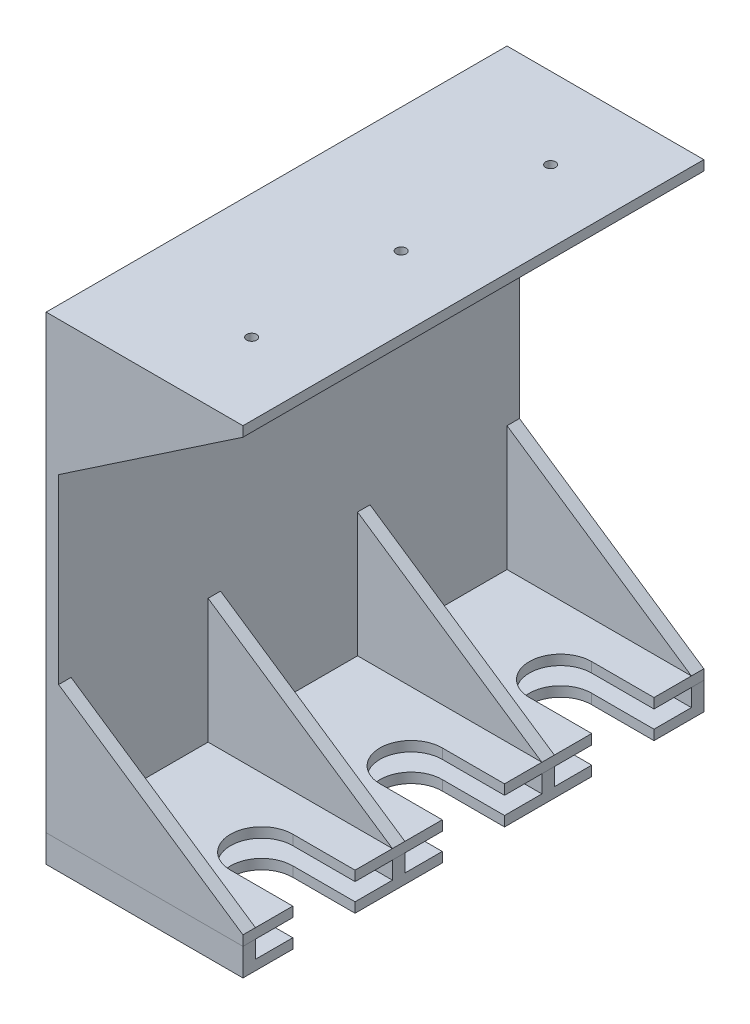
ISO-10303-21;
HEADER;
FILE_DESCRIPTION(('STEP AP214'),'2;1');
FILE_NAME('part.step','',(''),(''),'','','');
FILE_SCHEMA(('AUTOMOTIVE_DESIGN { 1 0 10303 214 1 1 1 1 }'));
ENDSEC;
DATA;
#1=APPLICATION_CONTEXT('core data for automotive mechanical design processes');
#2=APPLICATION_PROTOCOL_DEFINITION('international standard','automotive_design',2000,#1);
#3=PRODUCT_CONTEXT('',#1,'mechanical');
#4=PRODUCT('Part','Part','',(#3));
#5=PRODUCT_RELATED_PRODUCT_CATEGORY('part','',(#4));
#6=PRODUCT_DEFINITION_FORMATION('','',#4);
#7=PRODUCT_DEFINITION_CONTEXT('part definition',#1,'design');
#8=PRODUCT_DEFINITION('design','',#6,#7);
#9=PRODUCT_DEFINITION_SHAPE('','',#8);
#10=(LENGTH_UNIT() NAMED_UNIT(*) SI_UNIT(.MILLI.,.METRE.));
#11=(NAMED_UNIT(*) PLANE_ANGLE_UNIT() SI_UNIT($,.RADIAN.));
#12=(NAMED_UNIT(*) SI_UNIT($,.STERADIAN.) SOLID_ANGLE_UNIT());
#13=UNCERTAINTY_MEASURE_WITH_UNIT(LENGTH_MEASURE(1.E-05),#10,'distance_accuracy_value','');
#14=(GEOMETRIC_REPRESENTATION_CONTEXT(3) GLOBAL_UNCERTAINTY_ASSIGNED_CONTEXT((#13)) GLOBAL_UNIT_ASSIGNED_CONTEXT((#10,
#11,#12)) REPRESENTATION_CONTEXT('',''));
#15=CARTESIAN_POINT('',(0.,0.,0.));
#16=DIRECTION('',(0.,0.,1.));
#17=DIRECTION('',(1.,0.,0.));
#18=AXIS2_PLACEMENT_3D('',#15,#16,#17);
#19=CARTESIAN_POINT('',(0.,188.,0.));
#20=DIRECTION('',(0.,-1.,0.));
#21=DIRECTION('',(0.,0.,-1.));
#22=AXIS2_PLACEMENT_3D('',#19,#20,#21);
#23=PLANE('',#22);
#24=DIRECTION('',(-1.,0.,0.));
#25=VECTOR('',#24,1.);
#26=CARTESIAN_POINT('',(-1.69144233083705,188.,-66.1870389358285));
#27=LINE('',#26,#25);
#28=CARTESIAN_POINT('',(77.3072948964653,188.,-66.1870389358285));
#29=VERTEX_POINT('',#28);
#30=CARTESIAN_POINT('',(3.30855766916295,188.,-66.1870389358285));
#31=VERTEX_POINT('',#30);
#32=EDGE_CURVE('E62',#29,#31,#27,.T.);
#33=ORIENTED_EDGE('',*,*,#32,.F.);
#34=DIRECTION('',(0.,0.,1.));
#35=VECTOR('',#34,1.);
#36=CARTESIAN_POINT('',(77.3072948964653,188.,-66.1899960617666));
#37=LINE('',#36,#35);
#38=CARTESIAN_POINT('',(77.3072948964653,188.,-66.1899960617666));
#39=VERTEX_POINT('',#38);
#40=EDGE_CURVE('E366',#39,#29,#37,.T.);
#41=ORIENTED_EDGE('',*,*,#40,.F.);
#42=DIRECTION('',(-1.,0.,0.));
#43=VECTOR('',#42,1.);
#44=CARTESIAN_POINT('',(77.3072948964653,188.,-66.1899960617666));
#45=LINE('',#44,#43);
#46=CARTESIAN_POINT('',(3.30855766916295,188.,-66.1899960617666));
#47=VERTEX_POINT('',#46);
#48=EDGE_CURVE('E353',#39,#47,#45,.T.);
#49=ORIENTED_EDGE('',*,*,#48,.T.);
#50=DIRECTION('',(0.,0.,1.));
#51=VECTOR('',#50,1.);
#52=CARTESIAN_POINT('',(3.30855766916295,188.,-66.1899960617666));
#53=LINE('',#52,#51);
#54=EDGE_CURVE('E363',#47,#31,#53,.T.);
#55=ORIENTED_EDGE('',*,*,#54,.T.);
#56=EDGE_LOOP('',(#33,#41,#49,#55));
#57=FACE_BOUND('',#56,.T.);
#58=ADVANCED_FACE('F47',(#57),#23,.F.);
#59=CARTESIAN_POINT('',(52.2761348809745,15.,-33.6875185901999));
#60=DIRECTION('',(0.,1.,0.));
#61=DIRECTION('',(0.,0.,1.));
#62=AXIS2_PLACEMENT_3D('',#59,#60,#61);
#63=PLANE('',#62);
#64=DIRECTION('',(1.,0.,0.));
#65=VECTOR('',#64,1.);
#66=CARTESIAN_POINT('',(77.3072948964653,15.,-61.1899960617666));
#67=LINE('',#66,#65);
#68=CARTESIAN_POINT('',(3.30855766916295,15.,-61.1899960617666));
#69=VERTEX_POINT('',#68);
#70=CARTESIAN_POINT('',(77.3072948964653,15.,-61.1899960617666));
#71=VERTEX_POINT('',#70);
#72=EDGE_CURVE('E331',#69,#71,#67,.T.);
#73=ORIENTED_EDGE('',*,*,#72,.F.);
#74=DIRECTION('',(0.,0.,-1.));
#75=VECTOR('',#74,1.);
#76=CARTESIAN_POINT('',(3.30855766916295,15.,118.810003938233));
#77=LINE('',#76,#75);
#78=CARTESIAN_POINT('',(3.30855766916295,15.,-6.18999606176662));
#79=VERTEX_POINT('',#78);
#80=EDGE_CURVE('E442',#79,#69,#77,.T.);
#81=ORIENTED_EDGE('',*,*,#80,.F.);
#82=DIRECTION('',(1.,0.,0.));
#83=VECTOR('',#82,1.);
#84=CARTESIAN_POINT('',(77.3072948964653,15.,-6.18999606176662));
#85=LINE('',#84,#83);
#86=CARTESIAN_POINT('',(77.3072948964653,15.,-6.18999606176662));
#87=VERTEX_POINT('',#86);
#88=EDGE_CURVE('E374',#79,#87,#85,.T.);
#89=ORIENTED_EDGE('',*,*,#88,.T.);
#90=DIRECTION('',(0.,0.,-1.));
#91=VECTOR('',#90,1.);
#92=CARTESIAN_POINT('',(77.3072948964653,15.,13.8119786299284));
#93=LINE('',#92,#91);
#94=CARTESIAN_POINT('',(77.3072948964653,15.,-21.1876785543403));
#95=VERTEX_POINT('',#94);
#96=EDGE_CURVE('E482',#87,#95,#93,.T.);
#97=ORIENTED_EDGE('',*,*,#96,.T.);
#98=DIRECTION('',(-1.,0.,0.));
#99=VECTOR('',#98,1.);
#100=CARTESIAN_POINT('',(52.2761348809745,15.,-21.1876785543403));
#101=LINE('',#100,#99);
#102=CARTESIAN_POINT('',(52.2761348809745,15.,-21.1876785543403));
#103=VERTEX_POINT('',#102);
#104=EDGE_CURVE('E486',#95,#103,#101,.T.);
#105=ORIENTED_EDGE('',*,*,#104,.T.);
#106=CARTESIAN_POINT('',(52.2761348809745,15.,-33.6875185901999));
#107=DIRECTION('',(0.,-1.,0.));
#108=DIRECTION('',(0.,0.,1.));
#109=AXIS2_PLACEMENT_3D('',#106,#107,#108);
#110=CIRCLE('',#109,12.4998400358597);
#111=CARTESIAN_POINT('',(52.2761348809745,15.,-46.1873586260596));
#112=VERTEX_POINT('',#111);
#113=EDGE_CURVE('E488',#103,#112,#110,.T.);
#114=ORIENTED_EDGE('',*,*,#113,.T.);
#115=DIRECTION('',(1.,0.,0.));
#116=VECTOR('',#115,1.);
#117=CARTESIAN_POINT('',(52.2761348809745,15.,-46.1873586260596));
#118=LINE('',#117,#116);
#119=CARTESIAN_POINT('',(77.3072948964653,15.,-46.1873586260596));
#120=VERTEX_POINT('',#119);
#121=EDGE_CURVE('E490',#112,#120,#118,.T.);
#122=ORIENTED_EDGE('',*,*,#121,.T.);
#123=DIRECTION('',(0.,0.,-1.));
#124=VECTOR('',#123,1.);
#125=CARTESIAN_POINT('',(77.3072948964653,15.,-46.1873586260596));
#126=LINE('',#125,#124);
#127=EDGE_CURVE('E493',#120,#71,#126,.T.);
#128=ORIENTED_EDGE('',*,*,#127,.T.);
#129=EDGE_LOOP('',(#73,#81,#89,#97,#105,#114,#122,#128));
#130=FACE_BOUND('',#129,.T.);
#131=ADVANCED_FACE('F635',(#130),#63,.T.);
#132=CARTESIAN_POINT('',(3.30855766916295,188.,118.810003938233));
#133=DIRECTION('',(-1.,0.,0.));
#134=DIRECTION('',(0.,0.,1.));
#135=AXIS2_PLACEMENT_3D('',#132,#133,#134);
#136=PLANE('',#135);
#137=DIRECTION('',(0.,-1.,0.));
#138=VECTOR('',#137,1.);
#139=CARTESIAN_POINT('',(3.30855766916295,15.,-61.1899960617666));
#140=LINE('',#139,#138);
#141=CARTESIAN_POINT('',(3.30855766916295,65.,-61.1899960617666));
#142=VERTEX_POINT('',#141);
#143=EDGE_CURVE('E70',#142,#69,#140,.T.);
#144=ORIENTED_EDGE('',*,*,#143,.F.);
#145=DIRECTION('',(0.,0.,1.));
#146=VECTOR('',#145,1.);
#147=CARTESIAN_POINT('',(3.30855766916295,65.,-66.1899960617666));
#148=LINE('',#147,#146);
#149=CARTESIAN_POINT('',(3.30855766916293,65.0000000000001,-66.1870389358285));
#150=VERTEX_POINT('',#149);
#151=EDGE_CURVE('E340',#150,#142,#148,.T.);
#152=ORIENTED_EDGE('',*,*,#151,.F.);
#153=DIRECTION('',(0.,-1.,0.));
#154=VECTOR('',#153,1.);
#155=CARTESIAN_POINT('',(3.30855766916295,188.,-66.1870389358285));
#156=LINE('',#155,#154);
#157=CARTESIAN_POINT('',(3.30855766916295,138.,-66.1870389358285));
#158=VERTEX_POINT('',#157);
#159=EDGE_CURVE('E455',#158,#150,#156,.T.);
#160=ORIENTED_EDGE('',*,*,#159,.F.);
#161=DIRECTION('',(0.,0.,1.));
#162=VECTOR('',#161,1.);
#163=CARTESIAN_POINT('',(3.30855766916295,138.,-66.1899960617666));
#164=LINE('',#163,#162);
#165=CARTESIAN_POINT('',(3.30855766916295,138.,-61.1899960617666));
#166=VERTEX_POINT('',#165);
#167=EDGE_CURVE('E356',#158,#166,#164,.T.);
#168=ORIENTED_EDGE('',*,*,#167,.T.);
#169=DIRECTION('',(0.,-1.,0.));
#170=VECTOR('',#169,1.);
#171=CARTESIAN_POINT('',(3.30855766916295,188.,-61.1899960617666));
#172=LINE('',#171,#170);
#173=CARTESIAN_POINT('',(3.30855766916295,188.,-61.1899960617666));
#174=VERTEX_POINT('',#173);
#175=EDGE_CURVE('E339',#174,#166,#172,.T.);
#176=ORIENTED_EDGE('',*,*,#175,.F.);
#177=DIRECTION('',(0.,0.,-1.));
#178=VECTOR('',#177,1.);
#179=CARTESIAN_POINT('',(3.30855766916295,188.,118.810003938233));
#180=LINE('',#179,#178);
#181=CARTESIAN_POINT('',(3.30855766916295,188.,113.810003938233));
#182=VERTEX_POINT('',#181);
#183=EDGE_CURVE('E443',#182,#174,#180,.T.);
#184=ORIENTED_EDGE('',*,*,#183,.F.);
#185=DIRECTION('',(0.,-1.,0.));
#186=VECTOR('',#185,1.);
#187=CARTESIAN_POINT('',(3.30855766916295,138.,113.810003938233));
#188=LINE('',#187,#186);
#189=CARTESIAN_POINT('',(3.30855766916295,138.,113.810003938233));
#190=VERTEX_POINT('',#189);
#191=EDGE_CURVE('E415',#182,#190,#188,.T.);
#192=ORIENTED_EDGE('',*,*,#191,.T.);
#193=DIRECTION('',(0.,0.,1.));
#194=VECTOR('',#193,1.);
#195=CARTESIAN_POINT('',(3.30855766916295,138.,113.810003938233));
#196=LINE('',#195,#194);
#197=CARTESIAN_POINT('',(3.30855766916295,138.,118.810003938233));
#198=VERTEX_POINT('',#197);
#199=EDGE_CURVE('E423',#190,#198,#196,.T.);
#200=ORIENTED_EDGE('',*,*,#199,.T.);
#201=DIRECTION('',(0.,-1.,0.));
#202=VECTOR('',#201,1.);
#203=CARTESIAN_POINT('',(3.30855766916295,188.,118.810003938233));
#204=LINE('',#203,#202);
#205=CARTESIAN_POINT('',(3.30855766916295,65.,118.810003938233));
#206=VERTEX_POINT('',#205);
#207=EDGE_CURVE('E454',#198,#206,#204,.T.);
#208=ORIENTED_EDGE('',*,*,#207,.T.);
#209=DIRECTION('',(0.,0.,1.));
#210=VECTOR('',#209,1.);
#211=CARTESIAN_POINT('',(3.30855766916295,65.,113.810003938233));
#212=LINE('',#211,#210);
#213=CARTESIAN_POINT('',(3.30855766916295,65.,113.810003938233));
#214=VERTEX_POINT('',#213);
#215=EDGE_CURVE('E437',#214,#206,#212,.T.);
#216=ORIENTED_EDGE('',*,*,#215,.F.);
#217=DIRECTION('',(0.,-1.,0.));
#218=VECTOR('',#217,1.);
#219=CARTESIAN_POINT('',(3.30855766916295,65.,113.810003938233));
#220=LINE('',#219,#218);
#221=CARTESIAN_POINT('',(3.30855766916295,15.,113.810003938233));
#222=VERTEX_POINT('',#221);
#223=EDGE_CURVE('E433',#214,#222,#220,.T.);
#224=ORIENTED_EDGE('',*,*,#223,.T.);
#225=CARTESIAN_POINT('',(3.30855766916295,15.,58.8100039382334));
#226=VERTEX_POINT('',#225);
#227=EDGE_CURVE('E447',#222,#226,#77,.T.);
#228=ORIENTED_EDGE('',*,*,#227,.T.);
#229=DIRECTION('',(0.,-1.,0.));
#230=VECTOR('',#229,1.);
#231=CARTESIAN_POINT('',(3.30855766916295,15.,58.8100039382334));
#232=LINE('',#231,#230);
#233=CARTESIAN_POINT('',(3.30855766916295,65.,58.8100039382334));
#234=VERTEX_POINT('',#233);
#235=EDGE_CURVE('E392',#234,#226,#232,.T.);
#236=ORIENTED_EDGE('',*,*,#235,.F.);
#237=DIRECTION('',(0.,0.,1.));
#238=VECTOR('',#237,1.);
#239=CARTESIAN_POINT('',(3.30855766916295,65.,53.8100039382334));
#240=LINE('',#239,#238);
#241=CARTESIAN_POINT('',(3.30855766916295,65.,53.8100039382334));
#242=VERTEX_POINT('',#241);
#243=EDGE_CURVE('E409',#242,#234,#240,.T.);
#244=ORIENTED_EDGE('',*,*,#243,.F.);
#245=DIRECTION('',(0.,-1.,0.));
#246=VECTOR('',#245,1.);
#247=CARTESIAN_POINT('',(3.30855766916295,15.,53.8100039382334));
#248=LINE('',#247,#246);
#249=CARTESIAN_POINT('',(3.30855766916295,15.,53.8100039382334));
#250=VERTEX_POINT('',#249);
#251=EDGE_CURVE('E394',#242,#250,#248,.T.);
#252=ORIENTED_EDGE('',*,*,#251,.T.);
#253=CARTESIAN_POINT('',(3.30855766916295,15.,-1.18999606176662));
#254=VERTEX_POINT('',#253);
#255=EDGE_CURVE('E450',#250,#254,#77,.T.);
#256=ORIENTED_EDGE('',*,*,#255,.T.);
#257=DIRECTION('',(0.,-1.,0.));
#258=VECTOR('',#257,1.);
#259=CARTESIAN_POINT('',(3.30855766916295,15.,-1.18999606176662));
#260=LINE('',#259,#258);
#261=CARTESIAN_POINT('',(3.30855766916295,65.,-1.18999606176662));
#262=VERTEX_POINT('',#261);
#263=EDGE_CURVE('E365',#262,#254,#260,.T.);
#264=ORIENTED_EDGE('',*,*,#263,.F.);
#265=DIRECTION('',(0.,0.,1.));
#266=VECTOR('',#265,1.);
#267=CARTESIAN_POINT('',(3.30855766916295,65.,-6.18999606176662));
#268=LINE('',#267,#266);
#269=CARTESIAN_POINT('',(3.30855766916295,65.,-6.18999606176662));
#270=VERTEX_POINT('',#269);
#271=EDGE_CURVE('E389',#270,#262,#268,.T.);
#272=ORIENTED_EDGE('',*,*,#271,.F.);
#273=DIRECTION('',(0.,-1.,0.));
#274=VECTOR('',#273,1.);
#275=CARTESIAN_POINT('',(3.30855766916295,15.,-6.18999606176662));
#276=LINE('',#275,#274);
#277=EDGE_CURVE('E372',#270,#79,#276,.T.);
#278=ORIENTED_EDGE('',*,*,#277,.T.);
#279=ORIENTED_EDGE('',*,*,#80,.T.);
#280=EDGE_LOOP('',(#144,#152,#160,#168,#176,#184,#192,#200,#208,#216,#224,#228,#236,#244,#252,
#256,#264,#272,#278,#279));
#281=FACE_BOUND('',#280,.T.);
#282=ADVANCED_FACE('F600',(#281),#136,.F.);
#283=DIRECTION('',(1.,0.,0.));
#284=VECTOR('',#283,1.);
#285=CARTESIAN_POINT('',(77.3072948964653,15.,-1.18999606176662));
#286=LINE('',#285,#284);
#287=CARTESIAN_POINT('',(77.3072948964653,15.,-1.18999606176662));
#288=VERTEX_POINT('',#287);
#289=EDGE_CURVE('E384',#254,#288,#286,.T.);
#290=ORIENTED_EDGE('',*,*,#289,.F.);
#291=ORIENTED_EDGE('',*,*,#255,.F.);
#292=DIRECTION('',(1.,0.,0.));
#293=VECTOR('',#292,1.);
#294=CARTESIAN_POINT('',(77.3072948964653,15.,53.8100039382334));
#295=LINE('',#294,#293);
#296=CARTESIAN_POINT('',(77.3072948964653,15.,53.8100039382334));
#297=VERTEX_POINT('',#296);
#298=EDGE_CURVE('E397',#250,#297,#295,.T.);
#299=ORIENTED_EDGE('',*,*,#298,.T.);
#300=DIRECTION('',(0.,0.,-1.));
#301=VECTOR('',#300,1.);
#302=CARTESIAN_POINT('',(77.3072948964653,15.,73.8108315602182));
#303=LINE('',#302,#301);
#304=CARTESIAN_POINT('',(77.3072948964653,15.,38.81128269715));
#305=VERTEX_POINT('',#304);
#306=EDGE_CURVE('E472',#297,#305,#303,.T.);
#307=ORIENTED_EDGE('',*,*,#306,.T.);
#308=DIRECTION('',(-1.,0.,0.));
#309=VECTOR('',#308,1.);
#310=CARTESIAN_POINT('',(52.3076546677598,15.,38.81128269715));
#311=LINE('',#310,#309);
#312=CARTESIAN_POINT('',(52.3076546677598,15.,38.81128269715));
#313=VERTEX_POINT('',#312);
#314=EDGE_CURVE('E476',#305,#313,#311,.T.);
#315=ORIENTED_EDGE('',*,*,#314,.T.);
#316=CARTESIAN_POINT('',(52.3076546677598,15.,26.3116306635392));
#317=DIRECTION('',(0.,-1.,0.));
#318=DIRECTION('',(0.,0.,1.));
#319=AXIS2_PLACEMENT_3D('',#316,#317,#318);
#320=CIRCLE('',#319,12.4996520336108);
#321=CARTESIAN_POINT('',(52.3076546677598,15.,13.8119786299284));
#322=VERTEX_POINT('',#321);
#323=EDGE_CURVE('E478',#313,#322,#320,.T.);
#324=ORIENTED_EDGE('',*,*,#323,.T.);
#325=DIRECTION('',(1.,0.,0.));
#326=VECTOR('',#325,1.);
#327=CARTESIAN_POINT('',(52.3076546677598,15.,13.8119786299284));
#328=LINE('',#327,#326);
#329=CARTESIAN_POINT('',(77.3072948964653,15.,13.8119786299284));
#330=VERTEX_POINT('',#329);
#331=EDGE_CURVE('E480',#322,#330,#328,.T.);
#332=ORIENTED_EDGE('',*,*,#331,.T.);
#333=EDGE_CURVE('E483',#330,#288,#93,.T.);
#334=ORIENTED_EDGE('',*,*,#333,.T.);
#335=EDGE_LOOP('',(#290,#291,#299,#307,#315,#324,#332,#334));
#336=FACE_BOUND('',#335,.T.);
#337=ADVANCED_FACE('F616',(#336),#63,.T.);
#338=DIRECTION('',(1.,0.,0.));
#339=VECTOR('',#338,1.);
#340=CARTESIAN_POINT('',(77.3072948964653,15.,58.8100039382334));
#341=LINE('',#340,#339);
#342=CARTESIAN_POINT('',(77.3072948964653,15.,58.8100039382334));
#343=VERTEX_POINT('',#342);
#344=EDGE_CURVE('E406',#226,#343,#341,.T.);
#345=ORIENTED_EDGE('',*,*,#344,.F.);
#346=ORIENTED_EDGE('',*,*,#227,.F.);
#347=DIRECTION('',(1.,0.,0.));
#348=VECTOR('',#347,1.);
#349=CARTESIAN_POINT('',(3.30855766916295,15.,113.810003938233));
#350=LINE('',#349,#348);
#351=CARTESIAN_POINT('',(77.3072948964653,15.,113.810003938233));
#352=VERTEX_POINT('',#351);
#353=EDGE_CURVE('E435',#222,#352,#350,.T.);
#354=ORIENTED_EDGE('',*,*,#353,.T.);
#355=DIRECTION('',(0.,0.,-1.));
#356=VECTOR('',#355,1.);
#357=CARTESIAN_POINT('',(77.3072948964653,15.,118.810003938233));
#358=LINE('',#357,#356);
#359=CARTESIAN_POINT('',(77.3072948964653,15.,98.8102153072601));
#360=VERTEX_POINT('',#359);
#361=EDGE_CURVE('E461',#352,#360,#358,.T.);
#362=ORIENTED_EDGE('',*,*,#361,.T.);
#363=DIRECTION('',(-1.,0.,0.));
#364=VECTOR('',#363,1.);
#365=CARTESIAN_POINT('',(52.3076945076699,15.,98.8102153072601));
#366=LINE('',#365,#364);
#367=CARTESIAN_POINT('',(52.3076945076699,15.,98.8102153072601));
#368=VERTEX_POINT('',#367);
#369=EDGE_CURVE('E466',#360,#368,#366,.T.);
#370=ORIENTED_EDGE('',*,*,#369,.T.);
#371=CARTESIAN_POINT('',(52.3076945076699,15.,86.3105234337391));
#372=DIRECTION('',(0.,-1.,0.));
#373=DIRECTION('',(0.,0.,1.));
#374=AXIS2_PLACEMENT_3D('',#371,#372,#373);
#375=CIRCLE('',#374,12.499691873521);
#376=CARTESIAN_POINT('',(52.3076945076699,15.,73.8108315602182));
#377=VERTEX_POINT('',#376);
#378=EDGE_CURVE('E468',#368,#377,#375,.T.);
#379=ORIENTED_EDGE('',*,*,#378,.T.);
#380=DIRECTION('',(1.,0.,0.));
#381=VECTOR('',#380,1.);
#382=CARTESIAN_POINT('',(52.3076945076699,15.,73.8108315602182));
#383=LINE('',#382,#381);
#384=CARTESIAN_POINT('',(77.3072948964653,15.,73.8108315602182));
#385=VERTEX_POINT('',#384);
#386=EDGE_CURVE('E470',#377,#385,#383,.T.);
#387=ORIENTED_EDGE('',*,*,#386,.T.);
#388=EDGE_CURVE('E473',#385,#343,#303,.T.);
#389=ORIENTED_EDGE('',*,*,#388,.T.);
#390=EDGE_LOOP('',(#345,#346,#354,#362,#370,#379,#387,#389));
#391=FACE_BOUND('',#390,.T.);
#392=ADVANCED_FACE('F590',(#391),#63,.T.);
#393=CARTESIAN_POINT('',(-1.69144233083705,15.,-66.1870389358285));
#394=DIRECTION('',(0.,0.,1.));
#395=DIRECTION('',(1.,0.,0.));
#396=AXIS2_PLACEMENT_3D('',#393,#394,#395);
#397=PLANE('',#396);
#398=DIRECTION('',(-1.,0.,0.));
#399=VECTOR('',#398,1.);
#400=CARTESIAN_POINT('',(-1.69144233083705,11.,-66.1870389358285));
#401=LINE('',#400,#399);
#402=CARTESIAN_POINT('',(77.3072948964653,11.,-66.1870389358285));
#403=VERTEX_POINT('',#402);
#404=CARTESIAN_POINT('',(-1.69144233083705,11.,-66.1870389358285));
#405=VERTEX_POINT('',#404);
#406=EDGE_CURVE('E457',#403,#405,#401,.T.);
#407=ORIENTED_EDGE('',*,*,#406,.T.);
#408=DIRECTION('',(0.,-1.,0.));
#409=VECTOR('',#408,1.);
#410=CARTESIAN_POINT('',(-1.69144233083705,15.,-66.1870389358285));
#411=LINE('',#410,#409);
#412=CARTESIAN_POINT('',(-1.69144233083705,192.,-66.1870389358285));
#413=VERTEX_POINT('',#412);
#414=EDGE_CURVE('E12',#413,#405,#411,.T.);
#415=ORIENTED_EDGE('',*,*,#414,.F.);
#416=DIRECTION('',(-1.,0.,0.));
#417=VECTOR('',#416,1.);
#418=CARTESIAN_POINT('',(-1.69144233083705,192.,-66.1870389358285));
#419=LINE('',#418,#417);
#420=CARTESIAN_POINT('',(77.3072948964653,192.,-66.1870389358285));
#421=VERTEX_POINT('',#420);
#422=EDGE_CURVE('E302',#421,#413,#419,.T.);
#423=ORIENTED_EDGE('',*,*,#422,.F.);
#424=DIRECTION('',(0.,-1.,0.));
#425=VECTOR('',#424,1.);
#426=CARTESIAN_POINT('',(77.3072948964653,192.,-66.1870389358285));
#427=LINE('',#426,#425);
#428=EDGE_CURVE('E312',#421,#29,#427,.T.);
#429=ORIENTED_EDGE('',*,*,#428,.T.);
#430=ORIENTED_EDGE('',*,*,#32,.T.);
#431=EDGE_CURVE('E451',#31,#158,#156,.T.);
#432=ORIENTED_EDGE('',*,*,#431,.T.);
#433=ORIENTED_EDGE('',*,*,#159,.T.);
#434=CARTESIAN_POINT('',(3.30855766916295,15.,-66.1870389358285));
#435=VERTEX_POINT('',#434);
#436=EDGE_CURVE('E446',#150,#435,#156,.T.);
#437=ORIENTED_EDGE('',*,*,#436,.T.);
#438=DIRECTION('',(-1.,0.,0.));
#439=VECTOR('',#438,1.);
#440=CARTESIAN_POINT('',(-1.69144233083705,15.,-66.1870389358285));
#441=LINE('',#440,#439);
#442=CARTESIAN_POINT('',(77.3072948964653,15.,-66.1870389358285));
#443=VERTEX_POINT('',#442);
#444=EDGE_CURVE('E458',#443,#435,#441,.T.);
#445=ORIENTED_EDGE('',*,*,#444,.F.);
#446=DIRECTION('',(0.,-1.,0.));
#447=VECTOR('',#446,1.);
#448=CARTESIAN_POINT('',(77.3072948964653,15.,-66.1870389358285));
#449=LINE('',#448,#447);
#450=EDGE_CURVE('E496',#443,#403,#449,.T.);
#451=ORIENTED_EDGE('',*,*,#450,.T.);
#452=EDGE_LOOP('',(#407,#415,#423,#429,#430,#432,#433,#437,#445,#451));
#453=FACE_BOUND('',#452,.T.);
#454=ADVANCED_FACE('F49',(#453),#397,.F.);
#455=CARTESIAN_POINT('',(-1.69144233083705,15.,-66.1870389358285));
#456=DIRECTION('',(1.,0.,0.));
#457=DIRECTION('',(0.,0.,-1.));
#458=AXIS2_PLACEMENT_3D('',#455,#456,#457);
#459=PLANE('',#458);
#460=DIRECTION('',(0.,0.,1.));
#461=VECTOR('',#460,1.);
#462=CARTESIAN_POINT('',(-1.69144233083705,11.,-66.1870389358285));
#463=LINE('',#462,#461);
#464=CARTESIAN_POINT('',(-1.69144233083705,11.,118.810003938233));
#465=VERTEX_POINT('',#464);
#466=EDGE_CURVE('E285',#405,#465,#463,.T.);
#467=ORIENTED_EDGE('',*,*,#466,.T.);
#468=DIRECTION('',(0.,-1.,0.));
#469=VECTOR('',#468,1.);
#470=CARTESIAN_POINT('',(-1.69144233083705,15.,118.810003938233));
#471=LINE('',#470,#469);
#472=CARTESIAN_POINT('',(-1.69144233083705,192.,118.810003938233));
#473=VERTEX_POINT('',#472);
#474=EDGE_CURVE('E55',#473,#465,#471,.T.);
#475=ORIENTED_EDGE('',*,*,#474,.F.);
#476=DIRECTION('',(0.,0.,1.));
#477=VECTOR('',#476,1.);
#478=CARTESIAN_POINT('',(-1.69144233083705,192.,-66.1870389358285));
#479=LINE('',#478,#477);
#480=EDGE_CURVE('E284',#413,#473,#479,.T.);
#481=ORIENTED_EDGE('',*,*,#480,.F.);
#482=ORIENTED_EDGE('',*,*,#414,.T.);
#483=EDGE_LOOP('',(#467,#475,#481,#482));
#484=FACE_BOUND('',#483,.T.);
#485=ADVANCED_FACE('F282',(#484),#459,.F.);
#486=CARTESIAN_POINT('',(77.3072948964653,15.,118.810003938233));
#487=DIRECTION('',(0.,0.,-1.));
#488=DIRECTION('',(-1.,0.,0.));
#489=AXIS2_PLACEMENT_3D('',#486,#487,#488);
#490=PLANE('',#489);
#491=DIRECTION('',(0.,-1.,0.));
#492=VECTOR('',#491,1.);
#493=CARTESIAN_POINT('',(77.3072948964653,15.,118.810003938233));
#494=LINE('',#493,#492);
#495=CARTESIAN_POINT('',(77.3072948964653,15.,118.810003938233));
#496=VERTEX_POINT('',#495);
#497=CARTESIAN_POINT('',(77.3072948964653,11.,118.810003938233));
#498=VERTEX_POINT('',#497);
#499=EDGE_CURVE('E288',#496,#498,#494,.T.);
#500=ORIENTED_EDGE('',*,*,#499,.F.);
#501=DIRECTION('',(-0.828584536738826,0.55986397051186,0.));
#502=VECTOR('',#501,1.);
#503=CARTESIAN_POINT('',(77.3072948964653,15.,118.810003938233));
#504=LINE('',#503,#502);
#505=EDGE_CURVE('E427',#496,#206,#504,.T.);
#506=ORIENTED_EDGE('',*,*,#505,.T.);
#507=ORIENTED_EDGE('',*,*,#207,.F.);
#508=DIRECTION('',(0.828584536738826,0.55986397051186,0.));
#509=VECTOR('',#508,1.);
#510=CARTESIAN_POINT('',(77.3072948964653,188.,118.810003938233));
#511=LINE('',#510,#509);
#512=CARTESIAN_POINT('',(77.3072948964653,188.,118.810003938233));
#513=VERTEX_POINT('',#512);
#514=EDGE_CURVE('E412',#198,#513,#511,.T.);
#515=ORIENTED_EDGE('',*,*,#514,.T.);
#516=DIRECTION('',(0.,-1.,0.));
#517=VECTOR('',#516,1.);
#518=CARTESIAN_POINT('',(77.3072948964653,192.,118.810003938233));
#519=LINE('',#518,#517);
#520=CARTESIAN_POINT('',(77.3072948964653,192.,118.810003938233));
#521=VERTEX_POINT('',#520);
#522=EDGE_CURVE('E294',#521,#513,#519,.T.);
#523=ORIENTED_EDGE('',*,*,#522,.F.);
#524=DIRECTION('',(1.,0.,0.));
#525=VECTOR('',#524,1.);
#526=CARTESIAN_POINT('',(-1.69144233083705,192.,118.810003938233));
#527=LINE('',#526,#525);
#528=EDGE_CURVE('E290',#473,#521,#527,.T.);
#529=ORIENTED_EDGE('',*,*,#528,.F.);
#530=ORIENTED_EDGE('',*,*,#474,.T.);
#531=DIRECTION('',(1.,0.,0.));
#532=VECTOR('',#531,1.);
#533=CARTESIAN_POINT('',(77.3072948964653,11.,118.810003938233));
#534=LINE('',#533,#532);
#535=EDGE_CURVE('E500',#465,#498,#534,.T.);
#536=ORIENTED_EDGE('',*,*,#535,.T.);
#537=EDGE_LOOP('',(#500,#506,#507,#515,#523,#529,#530,#536));
#538=FACE_BOUND('',#537,.T.);
#539=ADVANCED_FACE('F291',(#538),#490,.F.);
#540=CARTESIAN_POINT('',(77.3072948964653,15.,118.810003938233));
#541=DIRECTION('',(-1.,0.,0.));
#542=DIRECTION('',(0.,0.,1.));
#543=AXIS2_PLACEMENT_3D('',#540,#541,#542);
#544=PLANE('',#543);
#545=DIRECTION('',(0.,0.,-1.));
#546=VECTOR('',#545,1.);
#547=CARTESIAN_POINT('',(77.3072948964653,11.,118.810003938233));
#548=LINE('',#547,#546);
#549=CARTESIAN_POINT('',(77.3072948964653,11.,98.8102153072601));
#550=VERTEX_POINT('',#549);
#551=EDGE_CURVE('E502',#498,#550,#548,.T.);
#552=ORIENTED_EDGE('',*,*,#551,.T.);
#553=DIRECTION('',(0.,-1.,0.));
#554=VECTOR('',#553,1.);
#555=CARTESIAN_POINT('',(77.3072948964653,15.,98.8102153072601));
#556=LINE('',#555,#554);
#557=EDGE_CURVE('E562',#360,#550,#556,.T.);
#558=ORIENTED_EDGE('',*,*,#557,.F.);
#559=ORIENTED_EDGE('',*,*,#361,.F.);
#560=EDGE_CURVE('E463',#496,#352,#358,.T.);
#561=ORIENTED_EDGE('',*,*,#560,.F.);
#562=ORIENTED_EDGE('',*,*,#499,.T.);
#563=EDGE_LOOP('',(#552,#558,#559,#561,#562));
#564=FACE_BOUND('',#563,.T.);
#565=ADVANCED_FACE('F569',(#564),#544,.F.);
#566=CARTESIAN_POINT('',(52.3076945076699,15.,98.8102153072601));
#567=DIRECTION('',(0.,0.,1.));
#568=DIRECTION('',(1.,0.,0.));
#569=AXIS2_PLACEMENT_3D('',#566,#567,#568);
#570=PLANE('',#569);
#571=DIRECTION('',(-1.,0.,0.));
#572=VECTOR('',#571,1.);
#573=CARTESIAN_POINT('',(52.3076945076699,11.,98.8102153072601));
#574=LINE('',#573,#572);
#575=CARTESIAN_POINT('',(52.3076945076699,11.,98.8102153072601));
#576=VERTEX_POINT('',#575);
#577=EDGE_CURVE('E504',#550,#576,#574,.T.);
#578=ORIENTED_EDGE('',*,*,#577,.T.);
#579=DIRECTION('',(0.,-1.,0.));
#580=VECTOR('',#579,1.);
#581=CARTESIAN_POINT('',(52.3076945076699,15.,98.8102153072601));
#582=LINE('',#581,#580);
#583=EDGE_CURVE('E559',#368,#576,#582,.T.);
#584=ORIENTED_EDGE('',*,*,#583,.F.);
#585=ORIENTED_EDGE('',*,*,#369,.F.);
#586=ORIENTED_EDGE('',*,*,#557,.T.);
#587=EDGE_LOOP('',(#578,#584,#585,#586));
#588=FACE_BOUND('',#587,.T.);
#589=ADVANCED_FACE('F581',(#588),#570,.F.);
#590=CARTESIAN_POINT('',(52.3076945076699,15.,86.3105234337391));
#591=DIRECTION('',(0.,-1.,0.));
#592=DIRECTION('',(0.,0.,-1.));
#593=AXIS2_PLACEMENT_3D('',#590,#591,#592);
#594=CYLINDRICAL_SURFACE('',#593,12.499691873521);
#595=CARTESIAN_POINT('',(52.3076945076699,11.,86.3105234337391));
#596=DIRECTION('',(0.,-1.,0.));
#597=DIRECTION('',(0.,0.,1.));
#598=AXIS2_PLACEMENT_3D('',#595,#596,#597);
#599=CIRCLE('',#598,12.499691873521);
#600=CARTESIAN_POINT('',(52.3076945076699,11.,73.8108315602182));
#601=VERTEX_POINT('',#600);
#602=EDGE_CURVE('E506',#576,#601,#599,.T.);
#603=ORIENTED_EDGE('',*,*,#602,.T.);
#604=DIRECTION('',(0.,-1.,0.));
#605=VECTOR('',#604,1.);
#606=CARTESIAN_POINT('',(52.3076945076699,15.,73.8108315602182));
#607=LINE('',#606,#605);
#608=EDGE_CURVE('E556',#377,#601,#607,.T.);
#609=ORIENTED_EDGE('',*,*,#608,.F.);
#610=ORIENTED_EDGE('',*,*,#378,.F.);
#611=ORIENTED_EDGE('',*,*,#583,.T.);
#612=EDGE_LOOP('',(#603,#609,#610,#611));
#613=FACE_BOUND('',#612,.T.);
#614=ADVANCED_FACE('F585',(#613),#594,.F.);
#615=CARTESIAN_POINT('',(52.3076945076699,15.,73.8108315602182));
#616=DIRECTION('',(0.,0.,-1.));
#617=DIRECTION('',(-1.,0.,0.));
#618=AXIS2_PLACEMENT_3D('',#615,#616,#617);
#619=PLANE('',#618);
#620=DIRECTION('',(1.,0.,0.));
#621=VECTOR('',#620,1.);
#622=CARTESIAN_POINT('',(52.3076945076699,11.,73.8108315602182));
#623=LINE('',#622,#621);
#624=CARTESIAN_POINT('',(77.3072948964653,11.,73.8108315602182));
#625=VERTEX_POINT('',#624);
#626=EDGE_CURVE('E508',#601,#625,#623,.T.);
#627=ORIENTED_EDGE('',*,*,#626,.T.);
#628=DIRECTION('',(0.,-1.,0.));
#629=VECTOR('',#628,1.);
#630=CARTESIAN_POINT('',(77.3072948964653,15.,73.8108315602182));
#631=LINE('',#630,#629);
#632=EDGE_CURVE('E553',#385,#625,#631,.T.);
#633=ORIENTED_EDGE('',*,*,#632,.F.);
#634=ORIENTED_EDGE('',*,*,#386,.F.);
#635=ORIENTED_EDGE('',*,*,#608,.T.);
#636=EDGE_LOOP('',(#627,#633,#634,#635));
#637=FACE_BOUND('',#636,.T.);
#638=ADVANCED_FACE('F716',(#637),#619,.F.);
#639=CARTESIAN_POINT('',(77.3072948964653,15.,73.8108315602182));
#640=DIRECTION('',(-1.,0.,0.));
#641=DIRECTION('',(0.,0.,1.));
#642=AXIS2_PLACEMENT_3D('',#639,#640,#641);
#643=PLANE('',#642);
#644=DIRECTION('',(0.,0.,-1.));
#645=VECTOR('',#644,1.);
#646=CARTESIAN_POINT('',(77.3072948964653,11.,73.8108315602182));
#647=LINE('',#646,#645);
#648=CARTESIAN_POINT('',(77.3072948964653,11.,38.81128269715));
#649=VERTEX_POINT('',#648);
#650=EDGE_CURVE('E510',#625,#649,#647,.T.);
#651=ORIENTED_EDGE('',*,*,#650,.T.);
#652=DIRECTION('',(0.,-1.,0.));
#653=VECTOR('',#652,1.);
#654=CARTESIAN_POINT('',(77.3072948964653,15.,38.81128269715));
#655=LINE('',#654,#653);
#656=EDGE_CURVE('E550',#305,#649,#655,.T.);
#657=ORIENTED_EDGE('',*,*,#656,.F.);
#658=ORIENTED_EDGE('',*,*,#306,.F.);
#659=DIRECTION('',(0.,0.,1.));
#660=VECTOR('',#659,1.);
#661=CARTESIAN_POINT('',(77.3072948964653,15.,53.8100039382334));
#662=LINE('',#661,#660);
#663=EDGE_CURVE('E404',#297,#343,#662,.T.);
#664=ORIENTED_EDGE('',*,*,#663,.T.);
#665=ORIENTED_EDGE('',*,*,#388,.F.);
#666=ORIENTED_EDGE('',*,*,#632,.T.);
#667=EDGE_LOOP('',(#651,#657,#658,#664,#665,#666));
#668=FACE_BOUND('',#667,.T.);
#669=ADVANCED_FACE('F612',(#668),#643,.F.);
#670=CARTESIAN_POINT('',(52.3076546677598,15.,38.81128269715));
#671=DIRECTION('',(0.,0.,1.));
#672=DIRECTION('',(1.,0.,0.));
#673=AXIS2_PLACEMENT_3D('',#670,#671,#672);
#674=PLANE('',#673);
#675=DIRECTION('',(-1.,0.,0.));
#676=VECTOR('',#675,1.);
#677=CARTESIAN_POINT('',(52.3076546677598,11.,38.81128269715));
#678=LINE('',#677,#676);
#679=CARTESIAN_POINT('',(52.3076546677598,11.,38.81128269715));
#680=VERTEX_POINT('',#679);
#681=EDGE_CURVE('E512',#649,#680,#678,.T.);
#682=ORIENTED_EDGE('',*,*,#681,.T.);
#683=DIRECTION('',(0.,-1.,0.));
#684=VECTOR('',#683,1.);
#685=CARTESIAN_POINT('',(52.3076546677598,15.,38.81128269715));
#686=LINE('',#685,#684);
#687=EDGE_CURVE('E547',#313,#680,#686,.T.);
#688=ORIENTED_EDGE('',*,*,#687,.F.);
#689=ORIENTED_EDGE('',*,*,#314,.F.);
#690=ORIENTED_EDGE('',*,*,#656,.T.);
#691=EDGE_LOOP('',(#682,#688,#689,#690));
#692=FACE_BOUND('',#691,.T.);
#693=ADVANCED_FACE('F709',(#692),#674,.F.);
#694=CARTESIAN_POINT('',(52.3076546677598,15.,26.3116306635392));
#695=DIRECTION('',(0.,-1.,0.));
#696=DIRECTION('',(0.,0.,-1.));
#697=AXIS2_PLACEMENT_3D('',#694,#695,#696);
#698=CYLINDRICAL_SURFACE('',#697,12.4996520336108);
#699=CARTESIAN_POINT('',(52.3076546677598,11.,26.3116306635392));
#700=DIRECTION('',(0.,-1.,0.));
#701=DIRECTION('',(0.,0.,1.));
#702=AXIS2_PLACEMENT_3D('',#699,#700,#701);
#703=CIRCLE('',#702,12.4996520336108);
#704=CARTESIAN_POINT('',(52.3076546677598,11.,13.8119786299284));
#705=VERTEX_POINT('',#704);
#706=EDGE_CURVE('E514',#680,#705,#703,.T.);
#707=ORIENTED_EDGE('',*,*,#706,.T.);
#708=DIRECTION('',(0.,-1.,0.));
#709=VECTOR('',#708,1.);
#710=CARTESIAN_POINT('',(52.3076546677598,15.,13.8119786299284));
#711=LINE('',#710,#709);
#712=EDGE_CURVE('E544',#322,#705,#711,.T.);
#713=ORIENTED_EDGE('',*,*,#712,.F.);
#714=ORIENTED_EDGE('',*,*,#323,.F.);
#715=ORIENTED_EDGE('',*,*,#687,.T.);
#716=EDGE_LOOP('',(#707,#713,#714,#715));
#717=FACE_BOUND('',#716,.T.);
#718=ADVANCED_FACE('F705',(#717),#698,.F.);
#719=CARTESIAN_POINT('',(52.3076546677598,15.,13.8119786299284));
#720=DIRECTION('',(0.,0.,-1.));
#721=DIRECTION('',(-1.,0.,0.));
#722=AXIS2_PLACEMENT_3D('',#719,#720,#721);
#723=PLANE('',#722);
#724=DIRECTION('',(1.,0.,0.));
#725=VECTOR('',#724,1.);
#726=CARTESIAN_POINT('',(52.3076546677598,11.,13.8119786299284));
#727=LINE('',#726,#725);
#728=CARTESIAN_POINT('',(77.3072948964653,11.,13.8119786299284));
#729=VERTEX_POINT('',#728);
#730=EDGE_CURVE('E516',#705,#729,#727,.T.);
#731=ORIENTED_EDGE('',*,*,#730,.T.);
#732=DIRECTION('',(0.,-1.,0.));
#733=VECTOR('',#732,1.);
#734=CARTESIAN_POINT('',(77.3072948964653,15.,13.8119786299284));
#735=LINE('',#734,#733);
#736=EDGE_CURVE('E541',#330,#729,#735,.T.);
#737=ORIENTED_EDGE('',*,*,#736,.F.);
#738=ORIENTED_EDGE('',*,*,#331,.F.);
#739=ORIENTED_EDGE('',*,*,#712,.T.);
#740=EDGE_LOOP('',(#731,#737,#738,#739));
#741=FACE_BOUND('',#740,.T.);
#742=ADVANCED_FACE('F701',(#741),#723,.F.);
#743=CARTESIAN_POINT('',(77.3072948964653,15.,13.8119786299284));
#744=DIRECTION('',(-1.,0.,0.));
#745=DIRECTION('',(0.,0.,1.));
#746=AXIS2_PLACEMENT_3D('',#743,#744,#745);
#747=PLANE('',#746);
#748=DIRECTION('',(0.,0.,-1.));
#749=VECTOR('',#748,1.);
#750=CARTESIAN_POINT('',(77.3072948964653,11.,13.8119786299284));
#751=LINE('',#750,#749);
#752=CARTESIAN_POINT('',(77.3072948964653,11.,-21.1876785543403));
#753=VERTEX_POINT('',#752);
#754=EDGE_CURVE('E518',#729,#753,#751,.T.);
#755=ORIENTED_EDGE('',*,*,#754,.T.);
#756=DIRECTION('',(0.,-1.,0.));
#757=VECTOR('',#756,1.);
#758=CARTESIAN_POINT('',(77.3072948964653,15.,-21.1876785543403));
#759=LINE('',#758,#757);
#760=EDGE_CURVE('E538',#95,#753,#759,.T.);
#761=ORIENTED_EDGE('',*,*,#760,.F.);
#762=ORIENTED_EDGE('',*,*,#96,.F.);
#763=DIRECTION('',(0.,0.,1.));
#764=VECTOR('',#763,1.);
#765=CARTESIAN_POINT('',(77.3072948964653,15.,-6.18999606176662));
#766=LINE('',#765,#764);
#767=EDGE_CURVE('E381',#87,#288,#766,.T.);
#768=ORIENTED_EDGE('',*,*,#767,.T.);
#769=ORIENTED_EDGE('',*,*,#333,.F.);
#770=ORIENTED_EDGE('',*,*,#736,.T.);
#771=EDGE_LOOP('',(#755,#761,#762,#768,#769,#770));
#772=FACE_BOUND('',#771,.T.);
#773=ADVANCED_FACE('F697',(#772),#747,.F.);
#774=CARTESIAN_POINT('',(52.2761348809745,15.,-21.1876785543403));
#775=DIRECTION('',(0.,0.,1.));
#776=DIRECTION('',(1.,0.,0.));
#777=AXIS2_PLACEMENT_3D('',#774,#775,#776);
#778=PLANE('',#777);
#779=DIRECTION('',(-1.,0.,0.));
#780=VECTOR('',#779,1.);
#781=CARTESIAN_POINT('',(52.2761348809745,11.,-21.1876785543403));
#782=LINE('',#781,#780);
#783=CARTESIAN_POINT('',(52.2761348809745,11.,-21.1876785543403));
#784=VERTEX_POINT('',#783);
#785=EDGE_CURVE('E520',#753,#784,#782,.T.);
#786=ORIENTED_EDGE('',*,*,#785,.T.);
#787=DIRECTION('',(0.,-1.,0.));
#788=VECTOR('',#787,1.);
#789=CARTESIAN_POINT('',(52.2761348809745,15.,-21.1876785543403));
#790=LINE('',#789,#788);
#791=EDGE_CURVE('E535',#103,#784,#790,.T.);
#792=ORIENTED_EDGE('',*,*,#791,.F.);
#793=ORIENTED_EDGE('',*,*,#104,.F.);
#794=ORIENTED_EDGE('',*,*,#760,.T.);
#795=EDGE_LOOP('',(#786,#792,#793,#794));
#796=FACE_BOUND('',#795,.T.);
#797=ADVANCED_FACE('F693',(#796),#778,.F.);
#798=CARTESIAN_POINT('',(52.2761348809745,15.,-33.6875185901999));
#799=DIRECTION('',(0.,-1.,0.));
#800=DIRECTION('',(0.,0.,-1.));
#801=AXIS2_PLACEMENT_3D('',#798,#799,#800);
#802=CYLINDRICAL_SURFACE('',#801,12.4998400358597);
#803=CARTESIAN_POINT('',(52.2761348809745,11.,-33.6875185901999));
#804=DIRECTION('',(0.,-1.,0.));
#805=DIRECTION('',(0.,0.,1.));
#806=AXIS2_PLACEMENT_3D('',#803,#804,#805);
#807=CIRCLE('',#806,12.4998400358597);
#808=CARTESIAN_POINT('',(52.2761348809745,11.,-46.1873586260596));
#809=VERTEX_POINT('',#808);
#810=EDGE_CURVE('E522',#784,#809,#807,.T.);
#811=ORIENTED_EDGE('',*,*,#810,.T.);
#812=DIRECTION('',(0.,-1.,0.));
#813=VECTOR('',#812,1.);
#814=CARTESIAN_POINT('',(52.2761348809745,15.,-46.1873586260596));
#815=LINE('',#814,#813);
#816=EDGE_CURVE('E532',#112,#809,#815,.T.);
#817=ORIENTED_EDGE('',*,*,#816,.F.);
#818=ORIENTED_EDGE('',*,*,#113,.F.);
#819=ORIENTED_EDGE('',*,*,#791,.T.);
#820=EDGE_LOOP('',(#811,#817,#818,#819));
#821=FACE_BOUND('',#820,.T.);
#822=ADVANCED_FACE('F689',(#821),#802,.F.);
#823=CARTESIAN_POINT('',(52.2761348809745,15.,-46.1873586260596));
#824=DIRECTION('',(0.,0.,-1.));
#825=DIRECTION('',(-1.,0.,0.));
#826=AXIS2_PLACEMENT_3D('',#823,#824,#825);
#827=PLANE('',#826);
#828=DIRECTION('',(1.,0.,0.));
#829=VECTOR('',#828,1.);
#830=CARTESIAN_POINT('',(52.2761348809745,11.,-46.1873586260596));
#831=LINE('',#830,#829);
#832=CARTESIAN_POINT('',(77.3072948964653,11.,-46.1873586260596));
#833=VERTEX_POINT('',#832);
#834=EDGE_CURVE('E524',#809,#833,#831,.T.);
#835=ORIENTED_EDGE('',*,*,#834,.T.);
#836=DIRECTION('',(0.,-1.,0.));
#837=VECTOR('',#836,1.);
#838=CARTESIAN_POINT('',(77.3072948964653,15.,-46.1873586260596));
#839=LINE('',#838,#837);
#840=EDGE_CURVE('E529',#120,#833,#839,.T.);
#841=ORIENTED_EDGE('',*,*,#840,.F.);
#842=ORIENTED_EDGE('',*,*,#121,.F.);
#843=ORIENTED_EDGE('',*,*,#816,.T.);
#844=EDGE_LOOP('',(#835,#841,#842,#843));
#845=FACE_BOUND('',#844,.T.);
#846=ADVANCED_FACE('F685',(#845),#827,.F.);
#847=CARTESIAN_POINT('',(77.3072948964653,15.,-46.1873586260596));
#848=DIRECTION('',(-1.,0.,0.));
#849=DIRECTION('',(0.,0.,1.));
#850=AXIS2_PLACEMENT_3D('',#847,#848,#849);
#851=PLANE('',#850);
#852=DIRECTION('',(0.,0.,-1.));
#853=VECTOR('',#852,1.);
#854=CARTESIAN_POINT('',(77.3072948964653,11.,-46.1873586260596));
#855=LINE('',#854,#853);
#856=EDGE_CURVE('E462',#833,#403,#855,.T.);
#857=ORIENTED_EDGE('',*,*,#856,.T.);
#858=ORIENTED_EDGE('',*,*,#450,.F.);
#859=EDGE_CURVE('E492',#71,#443,#126,.T.);
#860=ORIENTED_EDGE('',*,*,#859,.F.);
#861=ORIENTED_EDGE('',*,*,#127,.F.);
#862=ORIENTED_EDGE('',*,*,#840,.T.);
#863=EDGE_LOOP('',(#857,#858,#860,#861,#862));
#864=FACE_BOUND('',#863,.T.);
#865=ADVANCED_FACE('F682',(#864),#851,.F.);
#866=CARTESIAN_POINT('',(52.2761348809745,11.,-33.6875185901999));
#867=DIRECTION('',(0.,1.,0.));
#868=DIRECTION('',(0.,0.,1.));
#869=AXIS2_PLACEMENT_3D('',#866,#867,#868);
#870=PLANE('',#869);
#871=ORIENTED_EDGE('',*,*,#406,.F.);
#872=ORIENTED_EDGE('',*,*,#856,.F.);
#873=ORIENTED_EDGE('',*,*,#834,.F.);
#874=ORIENTED_EDGE('',*,*,#810,.F.);
#875=ORIENTED_EDGE('',*,*,#785,.F.);
#876=ORIENTED_EDGE('',*,*,#754,.F.);
#877=ORIENTED_EDGE('',*,*,#730,.F.);
#878=ORIENTED_EDGE('',*,*,#706,.F.);
#879=ORIENTED_EDGE('',*,*,#681,.F.);
#880=ORIENTED_EDGE('',*,*,#650,.F.);
#881=ORIENTED_EDGE('',*,*,#626,.F.);
#882=ORIENTED_EDGE('',*,*,#602,.F.);
#883=ORIENTED_EDGE('',*,*,#577,.F.);
#884=ORIENTED_EDGE('',*,*,#551,.F.);
#885=ORIENTED_EDGE('',*,*,#535,.F.);
#886=ORIENTED_EDGE('',*,*,#466,.F.);
#887=EDGE_LOOP('',(#871,#872,#873,#874,#875,#876,#877,#878,#879,#880,#881,#882,#883,#884,#885,#886));
#888=FACE_BOUND('',#887,.T.);
#889=ADVANCED_FACE('F576',(#888),#870,.F.);
#890=CARTESIAN_POINT('',(77.3072948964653,15.,113.810003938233));
#891=DIRECTION('',(0.55986397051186,0.828584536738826,0.));
#892=DIRECTION('',(-0.828584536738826,0.55986397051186,0.));
#893=AXIS2_PLACEMENT_3D('',#890,#891,#892);
#894=PLANE('',#893);
#895=ORIENTED_EDGE('',*,*,#505,.F.);
#896=ORIENTED_EDGE('',*,*,#560,.T.);
#897=DIRECTION('',(-0.828584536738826,0.55986397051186,0.));
#898=VECTOR('',#897,1.);
#899=CARTESIAN_POINT('',(77.3072948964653,15.,113.810003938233));
#900=LINE('',#899,#898);
#901=EDGE_CURVE('E430',#352,#214,#900,.T.);
#902=ORIENTED_EDGE('',*,*,#901,.T.);
#903=ORIENTED_EDGE('',*,*,#215,.T.);
#904=EDGE_LOOP('',(#895,#896,#902,#903));
#905=FACE_BOUND('',#904,.T.);
#906=ADVANCED_FACE('F596',(#905),#894,.T.);
#907=CARTESIAN_POINT('',(0.,0.,113.810003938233));
#908=DIRECTION('',(0.,0.,1.));
#909=DIRECTION('',(1.,0.,0.));
#910=AXIS2_PLACEMENT_3D('',#907,#908,#909);
#911=PLANE('',#910);
#912=ORIENTED_EDGE('',*,*,#901,.F.);
#913=ORIENTED_EDGE('',*,*,#353,.F.);
#914=ORIENTED_EDGE('',*,*,#223,.F.);
#915=EDGE_LOOP('',(#912,#913,#914));
#916=FACE_BOUND('',#915,.T.);
#917=ADVANCED_FACE('F599',(#916),#911,.F.);
#918=CARTESIAN_POINT('',(77.3072948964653,188.,113.810003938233));
#919=DIRECTION('',(0.55986397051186,-0.828584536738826,0.));
#920=DIRECTION('',(0.828584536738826,0.55986397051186,0.));
#921=AXIS2_PLACEMENT_3D('',#918,#919,#920);
#922=PLANE('',#921);
#923=ORIENTED_EDGE('',*,*,#514,.F.);
#924=ORIENTED_EDGE('',*,*,#199,.F.);
#925=DIRECTION('',(0.828584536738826,0.55986397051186,0.));
#926=VECTOR('',#925,1.);
#927=CARTESIAN_POINT('',(77.3072948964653,188.,113.810003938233));
#928=LINE('',#927,#926);
#929=CARTESIAN_POINT('',(77.3072948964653,188.,113.810003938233));
#930=VERTEX_POINT('',#929);
#931=EDGE_CURVE('E418',#190,#930,#928,.T.);
#932=ORIENTED_EDGE('',*,*,#931,.T.);
#933=DIRECTION('',(0.,0.,1.));
#934=VECTOR('',#933,1.);
#935=CARTESIAN_POINT('',(77.3072948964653,188.,113.810003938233));
#936=LINE('',#935,#934);
#937=EDGE_CURVE('E425',#930,#513,#936,.T.);
#938=ORIENTED_EDGE('',*,*,#937,.T.);
#939=EDGE_LOOP('',(#923,#924,#932,#938));
#940=FACE_BOUND('',#939,.T.);
#941=ADVANCED_FACE('F941',(#940),#922,.T.);
#942=CARTESIAN_POINT('',(0.,0.,113.810003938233));
#943=DIRECTION('',(0.,0.,-1.));
#944=DIRECTION('',(-1.,0.,0.));
#945=AXIS2_PLACEMENT_3D('',#942,#943,#944);
#946=PLANE('',#945);
#947=ORIENTED_EDGE('',*,*,#191,.F.);
#948=DIRECTION('',(-1.,0.,0.));
#949=VECTOR('',#948,1.);
#950=CARTESIAN_POINT('',(3.30855766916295,188.,113.810003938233));
#951=LINE('',#950,#949);
#952=EDGE_CURVE('E420',#930,#182,#951,.T.);
#953=ORIENTED_EDGE('',*,*,#952,.F.);
#954=ORIENTED_EDGE('',*,*,#931,.F.);
#955=EDGE_LOOP('',(#947,#953,#954));
#956=FACE_BOUND('',#955,.T.);
#957=ADVANCED_FACE('F946',(#956),#946,.T.);
#958=CARTESIAN_POINT('',(3.30855766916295,65.,53.8100039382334));
#959=DIRECTION('',(0.55986397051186,0.828584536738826,0.));
#960=DIRECTION('',(-0.828584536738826,0.55986397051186,0.));
#961=AXIS2_PLACEMENT_3D('',#958,#959,#960);
#962=PLANE('',#961);
#963=DIRECTION('',(-0.828584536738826,0.55986397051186,0.));
#964=VECTOR('',#963,1.);
#965=CARTESIAN_POINT('',(3.30855766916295,65.,58.8100039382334));
#966=LINE('',#965,#964);
#967=EDGE_CURVE('E398',#343,#234,#966,.T.);
#968=ORIENTED_EDGE('',*,*,#967,.F.);
#969=ORIENTED_EDGE('',*,*,#663,.F.);
#970=DIRECTION('',(-0.828584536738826,0.55986397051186,0.));
#971=VECTOR('',#970,1.);
#972=CARTESIAN_POINT('',(3.30855766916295,65.,53.8100039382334));
#973=LINE('',#972,#971);
#974=EDGE_CURVE('E401',#297,#242,#973,.T.);
#975=ORIENTED_EDGE('',*,*,#974,.T.);
#976=ORIENTED_EDGE('',*,*,#243,.T.);
#977=EDGE_LOOP('',(#968,#969,#975,#976));
#978=FACE_BOUND('',#977,.T.);
#979=ADVANCED_FACE('F607',(#978),#962,.T.);
#980=CARTESIAN_POINT('',(0.,0.,53.8100039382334));
#981=DIRECTION('',(0.,0.,1.));
#982=DIRECTION('',(1.,0.,0.));
#983=AXIS2_PLACEMENT_3D('',#980,#981,#982);
#984=PLANE('',#983);
#985=ORIENTED_EDGE('',*,*,#251,.F.);
#986=ORIENTED_EDGE('',*,*,#974,.F.);
#987=ORIENTED_EDGE('',*,*,#298,.F.);
#988=EDGE_LOOP('',(#985,#986,#987));
#989=FACE_BOUND('',#988,.T.);
#990=ADVANCED_FACE('F621',(#989),#984,.F.);
#991=CARTESIAN_POINT('',(0.,0.,58.8100039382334));
#992=DIRECTION('',(0.,0.,1.));
#993=DIRECTION('',(1.,0.,0.));
#994=AXIS2_PLACEMENT_3D('',#991,#992,#993);
#995=PLANE('',#994);
#996=ORIENTED_EDGE('',*,*,#235,.T.);
#997=ORIENTED_EDGE('',*,*,#344,.T.);
#998=ORIENTED_EDGE('',*,*,#967,.T.);
#999=EDGE_LOOP('',(#996,#997,#998));
#1000=FACE_BOUND('',#999,.T.);
#1001=ADVANCED_FACE('F605',(#1000),#995,.T.);
#1002=CARTESIAN_POINT('',(3.30855766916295,65.,-6.18999606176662));
#1003=DIRECTION('',(0.55986397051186,0.828584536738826,0.));
#1004=DIRECTION('',(-0.828584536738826,0.55986397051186,0.));
#1005=AXIS2_PLACEMENT_3D('',#1002,#1003,#1004);
#1006=PLANE('',#1005);
#1007=DIRECTION('',(-0.828584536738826,0.55986397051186,0.));
#1008=VECTOR('',#1007,1.);
#1009=CARTESIAN_POINT('',(3.30855766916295,65.,-1.18999606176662));
#1010=LINE('',#1009,#1008);
#1011=EDGE_CURVE('E375',#288,#262,#1010,.T.);
#1012=ORIENTED_EDGE('',*,*,#1011,.F.);
#1013=ORIENTED_EDGE('',*,*,#767,.F.);
#1014=DIRECTION('',(-0.828584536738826,0.55986397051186,0.));
#1015=VECTOR('',#1014,1.);
#1016=CARTESIAN_POINT('',(3.30855766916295,65.,-6.18999606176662));
#1017=LINE('',#1016,#1015);
#1018=EDGE_CURVE('E378',#87,#270,#1017,.T.);
#1019=ORIENTED_EDGE('',*,*,#1018,.T.);
#1020=ORIENTED_EDGE('',*,*,#271,.T.);
#1021=EDGE_LOOP('',(#1012,#1013,#1019,#1020));
#1022=FACE_BOUND('',#1021,.T.);
#1023=ADVANCED_FACE('F627',(#1022),#1006,.T.);
#1024=CARTESIAN_POINT('',(0.,0.,-6.18999606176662));
#1025=DIRECTION('',(0.,0.,1.));
#1026=DIRECTION('',(1.,0.,0.));
#1027=AXIS2_PLACEMENT_3D('',#1024,#1025,#1026);
#1028=PLANE('',#1027);
#1029=ORIENTED_EDGE('',*,*,#277,.F.);
#1030=ORIENTED_EDGE('',*,*,#1018,.F.);
#1031=ORIENTED_EDGE('',*,*,#88,.F.);
#1032=EDGE_LOOP('',(#1029,#1030,#1031));
#1033=FACE_BOUND('',#1032,.T.);
#1034=ADVANCED_FACE('F633',(#1033),#1028,.F.);
#1035=CARTESIAN_POINT('',(0.,0.,-1.18999606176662));
#1036=DIRECTION('',(0.,0.,1.));
#1037=DIRECTION('',(1.,0.,0.));
#1038=AXIS2_PLACEMENT_3D('',#1035,#1036,#1037);
#1039=PLANE('',#1038);
#1040=ORIENTED_EDGE('',*,*,#263,.T.);
#1041=ORIENTED_EDGE('',*,*,#289,.T.);
#1042=ORIENTED_EDGE('',*,*,#1011,.T.);
#1043=EDGE_LOOP('',(#1040,#1041,#1042));
#1044=FACE_BOUND('',#1043,.T.);
#1045=ADVANCED_FACE('F623',(#1044),#1039,.T.);
#1046=CARTESIAN_POINT('',(3.30855766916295,188.,-66.1899960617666));
#1047=DIRECTION('',(-1.,0.,0.));
#1048=DIRECTION('',(0.,0.,1.));
#1049=AXIS2_PLACEMENT_3D('',#1046,#1047,#1048);
#1050=PLANE('',#1049);
#1051=ORIENTED_EDGE('',*,*,#431,.F.);
#1052=ORIENTED_EDGE('',*,*,#54,.F.);
#1053=DIRECTION('',(0.,-1.,0.));
#1054=VECTOR('',#1053,1.);
#1055=CARTESIAN_POINT('',(3.30855766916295,188.,-66.1899960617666));
#1056=LINE('',#1055,#1054);
#1057=CARTESIAN_POINT('',(3.30855766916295,138.,-66.1899960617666));
#1058=VERTEX_POINT('',#1057);
#1059=EDGE_CURVE('E346',#47,#1058,#1056,.T.);
#1060=ORIENTED_EDGE('',*,*,#1059,.T.);
#1061=EDGE_CURVE('E369',#1058,#158,#164,.T.);
#1062=ORIENTED_EDGE('',*,*,#1061,.T.);
#1063=EDGE_LOOP('',(#1051,#1052,#1060,#1062));
#1064=FACE_BOUND('',#1063,.T.);
#1065=ADVANCED_FACE('F977',(#1064),#1050,.T.);
#1066=CARTESIAN_POINT('',(3.30855766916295,138.,-66.1899960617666));
#1067=DIRECTION('',(0.55986397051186,-0.828584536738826,0.));
#1068=DIRECTION('',(0.828584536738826,0.55986397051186,0.));
#1069=AXIS2_PLACEMENT_3D('',#1066,#1067,#1068);
#1070=PLANE('',#1069);
#1071=DIRECTION('',(0.828584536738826,0.55986397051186,0.));
#1072=VECTOR('',#1071,1.);
#1073=CARTESIAN_POINT('',(3.30855766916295,138.,-61.1899960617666));
#1074=LINE('',#1073,#1072);
#1075=CARTESIAN_POINT('',(77.3072948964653,188.,-61.1899960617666));
#1076=VERTEX_POINT('',#1075);
#1077=EDGE_CURVE('E359',#166,#1076,#1074,.T.);
#1078=ORIENTED_EDGE('',*,*,#1077,.F.);
#1079=ORIENTED_EDGE('',*,*,#167,.F.);
#1080=ORIENTED_EDGE('',*,*,#1061,.F.);
#1081=DIRECTION('',(0.828584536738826,0.55986397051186,0.));
#1082=VECTOR('',#1081,1.);
#1083=CARTESIAN_POINT('',(3.30855766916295,138.,-66.1899960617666));
#1084=LINE('',#1083,#1082);
#1085=EDGE_CURVE('E349',#1058,#39,#1084,.T.);
#1086=ORIENTED_EDGE('',*,*,#1085,.T.);
#1087=ORIENTED_EDGE('',*,*,#40,.T.);
#1088=EDGE_CURVE('E368',#29,#1076,#37,.T.);
#1089=ORIENTED_EDGE('',*,*,#1088,.T.);
#1090=EDGE_LOOP('',(#1078,#1079,#1080,#1086,#1087,#1089));
#1091=FACE_BOUND('',#1090,.T.);
#1092=ADVANCED_FACE('F779',(#1091),#1070,.T.);
#1093=CARTESIAN_POINT('',(0.,0.,-66.1899960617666));
#1094=DIRECTION('',(0.,0.,-1.));
#1095=DIRECTION('',(-1.,0.,0.));
#1096=AXIS2_PLACEMENT_3D('',#1093,#1094,#1095);
#1097=PLANE('',#1096);
#1098=ORIENTED_EDGE('',*,*,#1059,.F.);
#1099=ORIENTED_EDGE('',*,*,#48,.F.);
#1100=ORIENTED_EDGE('',*,*,#1085,.F.);
#1101=EDGE_LOOP('',(#1098,#1099,#1100));
#1102=FACE_BOUND('',#1101,.T.);
#1103=ADVANCED_FACE('F773',(#1102),#1097,.T.);
#1104=CARTESIAN_POINT('',(0.,0.,-61.1899960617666));
#1105=DIRECTION('',(0.,0.,-1.));
#1106=DIRECTION('',(-1.,0.,0.));
#1107=AXIS2_PLACEMENT_3D('',#1104,#1105,#1106);
#1108=PLANE('',#1107);
#1109=ORIENTED_EDGE('',*,*,#175,.T.);
#1110=ORIENTED_EDGE('',*,*,#1077,.T.);
#1111=DIRECTION('',(-1.,0.,0.));
#1112=VECTOR('',#1111,1.);
#1113=CARTESIAN_POINT('',(77.3072948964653,188.,-61.1899960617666));
#1114=LINE('',#1113,#1112);
#1115=EDGE_CURVE('E350',#1076,#174,#1114,.T.);
#1116=ORIENTED_EDGE('',*,*,#1115,.T.);
#1117=EDGE_LOOP('',(#1109,#1110,#1116));
#1118=FACE_BOUND('',#1117,.T.);
#1119=ADVANCED_FACE('F778',(#1118),#1108,.F.);
#1120=CARTESIAN_POINT('',(3.30855766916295,15.,-66.1899960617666));
#1121=DIRECTION('',(-1.,0.,0.));
#1122=DIRECTION('',(0.,-1.,0.));
#1123=AXIS2_PLACEMENT_3D('',#1120,#1121,#1122);
#1124=PLANE('',#1123);
#1125=ORIENTED_EDGE('',*,*,#436,.F.);
#1126=CARTESIAN_POINT('',(3.30855766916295,65.,-66.1899960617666));
#1127=VERTEX_POINT('',#1126);
#1128=EDGE_CURVE('E336',#1127,#150,#148,.T.);
#1129=ORIENTED_EDGE('',*,*,#1128,.F.);
#1130=DIRECTION('',(0.,-1.,0.));
#1131=VECTOR('',#1130,1.);
#1132=CARTESIAN_POINT('',(3.30855766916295,15.,-66.1899960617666));
#1133=LINE('',#1132,#1131);
#1134=CARTESIAN_POINT('',(3.30855766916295,15.,-66.1899960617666));
#1135=VERTEX_POINT('',#1134);
#1136=EDGE_CURVE('E319',#1127,#1135,#1133,.T.);
#1137=ORIENTED_EDGE('',*,*,#1136,.T.);
#1138=DIRECTION('',(0.,0.,1.));
#1139=VECTOR('',#1138,1.);
#1140=CARTESIAN_POINT('',(3.30855766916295,15.,-66.1899960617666));
#1141=LINE('',#1140,#1139);
#1142=EDGE_CURVE('E329',#1135,#435,#1141,.T.);
#1143=ORIENTED_EDGE('',*,*,#1142,.T.);
#1144=EDGE_LOOP('',(#1125,#1129,#1137,#1143));
#1145=FACE_BOUND('',#1144,.T.);
#1146=ADVANCED_FACE('F650',(#1145),#1124,.T.);
#1147=CARTESIAN_POINT('',(77.3072948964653,15.,-66.1899960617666));
#1148=DIRECTION('',(0.,-1.,0.));
#1149=DIRECTION('',(0.,0.,-1.));
#1150=AXIS2_PLACEMENT_3D('',#1147,#1148,#1149);
#1151=PLANE('',#1150);
#1152=ORIENTED_EDGE('',*,*,#444,.T.);
#1153=ORIENTED_EDGE('',*,*,#1142,.F.);
#1154=DIRECTION('',(1.,0.,0.));
#1155=VECTOR('',#1154,1.);
#1156=CARTESIAN_POINT('',(77.3072948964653,15.,-66.1899960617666));
#1157=LINE('',#1156,#1155);
#1158=CARTESIAN_POINT('',(77.3072948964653,15.,-66.1899960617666));
#1159=VERTEX_POINT('',#1158);
#1160=EDGE_CURVE('E322',#1135,#1159,#1157,.T.);
#1161=ORIENTED_EDGE('',*,*,#1160,.T.);
#1162=DIRECTION('',(0.,0.,1.));
#1163=VECTOR('',#1162,1.);
#1164=CARTESIAN_POINT('',(77.3072948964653,15.,-66.1899960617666));
#1165=LINE('',#1164,#1163);
#1166=EDGE_CURVE('E341',#1159,#443,#1165,.T.);
#1167=ORIENTED_EDGE('',*,*,#1166,.T.);
#1168=EDGE_LOOP('',(#1152,#1153,#1161,#1167));
#1169=FACE_BOUND('',#1168,.T.);
#1170=ADVANCED_FACE('F654',(#1169),#1151,.T.);
#1171=CARTESIAN_POINT('',(3.30855766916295,65.,-66.1899960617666));
#1172=DIRECTION('',(0.55986397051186,0.828584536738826,0.));
#1173=DIRECTION('',(-0.828584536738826,0.55986397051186,0.));
#1174=AXIS2_PLACEMENT_3D('',#1171,#1172,#1173);
#1175=PLANE('',#1174);
#1176=DIRECTION('',(-0.828584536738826,0.55986397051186,0.));
#1177=VECTOR('',#1176,1.);
#1178=CARTESIAN_POINT('',(3.30855766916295,65.,-61.1899960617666));
#1179=LINE('',#1178,#1177);
#1180=EDGE_CURVE('E323',#71,#142,#1179,.T.);
#1181=ORIENTED_EDGE('',*,*,#1180,.F.);
#1182=ORIENTED_EDGE('',*,*,#859,.T.);
#1183=ORIENTED_EDGE('',*,*,#1166,.F.);
#1184=DIRECTION('',(-0.828584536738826,0.55986397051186,0.));
#1185=VECTOR('',#1184,1.);
#1186=CARTESIAN_POINT('',(3.30855766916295,65.,-66.1899960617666));
#1187=LINE('',#1186,#1185);
#1188=EDGE_CURVE('E326',#1159,#1127,#1187,.T.);
#1189=ORIENTED_EDGE('',*,*,#1188,.T.);
#1190=ORIENTED_EDGE('',*,*,#1128,.T.);
#1191=ORIENTED_EDGE('',*,*,#151,.T.);
#1192=EDGE_LOOP('',(#1181,#1182,#1183,#1189,#1190,#1191));
#1193=FACE_BOUND('',#1192,.T.);
#1194=ADVANCED_FACE('F642',(#1193),#1175,.T.);
#1195=CARTESIAN_POINT('',(0.,0.,-66.1899960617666));
#1196=DIRECTION('',(0.,0.,1.));
#1197=DIRECTION('',(1.,0.,0.));
#1198=AXIS2_PLACEMENT_3D('',#1195,#1196,#1197);
#1199=PLANE('',#1198);
#1200=ORIENTED_EDGE('',*,*,#1136,.F.);
#1201=ORIENTED_EDGE('',*,*,#1188,.F.);
#1202=ORIENTED_EDGE('',*,*,#1160,.F.);
#1203=EDGE_LOOP('',(#1200,#1201,#1202));
#1204=FACE_BOUND('',#1203,.T.);
#1205=ADVANCED_FACE('F657',(#1204),#1199,.F.);
#1206=CARTESIAN_POINT('',(0.,0.,-61.1899960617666));
#1207=DIRECTION('',(0.,0.,1.));
#1208=DIRECTION('',(1.,0.,0.));
#1209=AXIS2_PLACEMENT_3D('',#1206,#1207,#1208);
#1210=PLANE('',#1209);
#1211=ORIENTED_EDGE('',*,*,#143,.T.);
#1212=ORIENTED_EDGE('',*,*,#72,.T.);
#1213=ORIENTED_EDGE('',*,*,#1180,.T.);
#1214=EDGE_LOOP('',(#1211,#1212,#1213));
#1215=FACE_BOUND('',#1214,.T.);
#1216=ADVANCED_FACE('F638',(#1215),#1210,.T.);
#1217=CARTESIAN_POINT('',(0.,188.,0.));
#1218=DIRECTION('',(0.,1.,0.));
#1219=DIRECTION('',(0.,0.,1.));
#1220=AXIS2_PLACEMENT_3D('',#1217,#1218,#1219);
#1221=PLANE('',#1220);
#1222=CARTESIAN_POINT('',(48.308557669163,188.,26.3100039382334));
#1223=DIRECTION('',(0.,1.,0.));
#1224=DIRECTION('',(0.,0.,1.));
#1225=AXIS2_PLACEMENT_3D('',#1222,#1223,#1224);
#1226=CIRCLE('',#1225,2.);
#1227=CARTESIAN_POINT('',(48.308557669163,188.,28.3100039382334));
#1228=VERTEX_POINT('',#1227);
#1229=EDGE_CURVE('E915',#1228,#1228,#1226,.T.);
#1230=ORIENTED_EDGE('',*,*,#1229,.T.);
#1231=EDGE_LOOP('',(#1230));
#1232=FACE_BOUND('',#1231,.T.);
#1233=CARTESIAN_POINT('',(48.308557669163,188.,86.3100039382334));
#1234=DIRECTION('',(0.,1.,0.));
#1235=DIRECTION('',(0.,0.,1.));
#1236=AXIS2_PLACEMENT_3D('',#1233,#1234,#1235);
#1237=CIRCLE('',#1236,2.);
#1238=CARTESIAN_POINT('',(48.308557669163,188.,88.3100039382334));
#1239=VERTEX_POINT('',#1238);
#1240=EDGE_CURVE('E919',#1239,#1239,#1237,.T.);
#1241=ORIENTED_EDGE('',*,*,#1240,.T.);
#1242=EDGE_LOOP('',(#1241));
#1243=FACE_BOUND('',#1242,.T.);
#1244=CARTESIAN_POINT('',(48.308557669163,188.,-33.6899960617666));
#1245=DIRECTION('',(0.,1.,0.));
#1246=DIRECTION('',(0.,0.,1.));
#1247=AXIS2_PLACEMENT_3D('',#1244,#1245,#1246);
#1248=CIRCLE('',#1247,2.);
#1249=CARTESIAN_POINT('',(48.308557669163,188.,-31.6899960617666));
#1250=VERTEX_POINT('',#1249);
#1251=EDGE_CURVE('E314',#1250,#1250,#1248,.T.);
#1252=ORIENTED_EDGE('',*,*,#1251,.T.);
#1253=EDGE_LOOP('',(#1252));
#1254=FACE_BOUND('',#1253,.T.);
#1255=DIRECTION('',(0.,0.,-1.));
#1256=VECTOR('',#1255,1.);
#1257=CARTESIAN_POINT('',(77.3072948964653,188.,-66.1870389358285));
#1258=LINE('',#1257,#1256);
#1259=EDGE_CURVE('E304',#930,#1076,#1258,.T.);
#1260=ORIENTED_EDGE('',*,*,#1259,.F.);
#1261=ORIENTED_EDGE('',*,*,#952,.T.);
#1262=ORIENTED_EDGE('',*,*,#183,.T.);
#1263=ORIENTED_EDGE('',*,*,#1115,.F.);
#1264=EDGE_LOOP('',(#1260,#1261,#1262,#1263));
#1265=FACE_BOUND('',#1264,.T.);
#1266=ADVANCED_FACE('F664',(#1232,#1243,#1254,#1265),#1221,.F.);
#1267=CARTESIAN_POINT('',(77.3072948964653,192.,-66.1870389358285));
#1268=DIRECTION('',(-1.,0.,0.));
#1269=DIRECTION('',(0.,0.,1.));
#1270=AXIS2_PLACEMENT_3D('',#1267,#1268,#1269);
#1271=PLANE('',#1270);
#1272=ORIENTED_EDGE('',*,*,#937,.F.);
#1273=ORIENTED_EDGE('',*,*,#1259,.T.);
#1274=ORIENTED_EDGE('',*,*,#1088,.F.);
#1275=ORIENTED_EDGE('',*,*,#428,.F.);
#1276=DIRECTION('',(0.,0.,-1.));
#1277=VECTOR('',#1276,1.);
#1278=CARTESIAN_POINT('',(77.3072948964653,192.,-66.1870389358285));
#1279=LINE('',#1278,#1277);
#1280=EDGE_CURVE('E297',#521,#421,#1279,.T.);
#1281=ORIENTED_EDGE('',*,*,#1280,.F.);
#1282=ORIENTED_EDGE('',*,*,#522,.T.);
#1283=EDGE_LOOP('',(#1272,#1273,#1274,#1275,#1281,#1282));
#1284=FACE_BOUND('',#1283,.T.);
#1285=ADVANCED_FACE('F860',(#1284),#1271,.F.);
#1286=CARTESIAN_POINT('',(0.,192.,0.));
#1287=DIRECTION('',(0.,1.,0.));
#1288=DIRECTION('',(0.,0.,1.));
#1289=AXIS2_PLACEMENT_3D('',#1286,#1287,#1288);
#1290=PLANE('',#1289);
#1291=CARTESIAN_POINT('',(48.308557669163,192.,26.3100039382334));
#1292=DIRECTION('',(0.,1.,0.));
#1293=DIRECTION('',(0.,0.,1.));
#1294=AXIS2_PLACEMENT_3D('',#1291,#1292,#1293);
#1295=CIRCLE('',#1294,2.);
#1296=CARTESIAN_POINT('',(48.308557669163,192.,28.3100039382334));
#1297=VERTEX_POINT('',#1296);
#1298=EDGE_CURVE('E918',#1297,#1297,#1295,.T.);
#1299=ORIENTED_EDGE('',*,*,#1298,.F.);
#1300=EDGE_LOOP('',(#1299));
#1301=FACE_BOUND('',#1300,.T.);
#1302=CARTESIAN_POINT('',(48.308557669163,192.,86.3100039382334));
#1303=DIRECTION('',(0.,1.,0.));
#1304=DIRECTION('',(0.,0.,1.));
#1305=AXIS2_PLACEMENT_3D('',#1302,#1303,#1304);
#1306=CIRCLE('',#1305,2.);
#1307=CARTESIAN_POINT('',(48.308557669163,192.,88.3100039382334));
#1308=VERTEX_POINT('',#1307);
#1309=EDGE_CURVE('E923',#1308,#1308,#1306,.T.);
#1310=ORIENTED_EDGE('',*,*,#1309,.F.);
#1311=EDGE_LOOP('',(#1310));
#1312=FACE_BOUND('',#1311,.T.);
#1313=CARTESIAN_POINT('',(48.308557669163,192.,-33.6899960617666));
#1314=DIRECTION('',(0.,1.,0.));
#1315=DIRECTION('',(0.,0.,1.));
#1316=AXIS2_PLACEMENT_3D('',#1313,#1314,#1315);
#1317=CIRCLE('',#1316,2.);
#1318=CARTESIAN_POINT('',(48.308557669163,192.,-31.6899960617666));
#1319=VERTEX_POINT('',#1318);
#1320=EDGE_CURVE('E307',#1319,#1319,#1317,.T.);
#1321=ORIENTED_EDGE('',*,*,#1320,.F.);
#1322=EDGE_LOOP('',(#1321));
#1323=FACE_BOUND('',#1322,.T.);
#1324=ORIENTED_EDGE('',*,*,#480,.T.);
#1325=ORIENTED_EDGE('',*,*,#528,.T.);
#1326=ORIENTED_EDGE('',*,*,#1280,.T.);
#1327=ORIENTED_EDGE('',*,*,#422,.T.);
#1328=EDGE_LOOP('',(#1324,#1325,#1326,#1327));
#1329=FACE_BOUND('',#1328,.T.);
#1330=ADVANCED_FACE('F300',(#1301,#1312,#1323,#1329),#1290,.T.);
#1331=CARTESIAN_POINT('',(48.308557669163,188.,-33.6899960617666));
#1332=DIRECTION('',(0.,1.,0.));
#1333=DIRECTION('',(0.,0.,1.));
#1334=AXIS2_PLACEMENT_3D('',#1331,#1332,#1333);
#1335=CYLINDRICAL_SURFACE('',#1334,2.);
#1336=ORIENTED_EDGE('',*,*,#1251,.F.);
#1337=EDGE_LOOP('',(#1336));
#1338=FACE_BOUND('',#1337,.T.);
#1339=ORIENTED_EDGE('',*,*,#1320,.T.);
#1340=EDGE_LOOP('',(#1339));
#1341=FACE_BOUND('',#1340,.T.);
#1342=ADVANCED_FACE('F877',(#1338,#1341),#1335,.F.);
#1343=CARTESIAN_POINT('',(48.308557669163,188.,86.3100039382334));
#1344=DIRECTION('',(0.,1.,0.));
#1345=DIRECTION('',(0.,0.,1.));
#1346=AXIS2_PLACEMENT_3D('',#1343,#1344,#1345);
#1347=CYLINDRICAL_SURFACE('',#1346,2.);
#1348=ORIENTED_EDGE('',*,*,#1240,.F.);
#1349=EDGE_LOOP('',(#1348));
#1350=FACE_BOUND('',#1349,.T.);
#1351=ORIENTED_EDGE('',*,*,#1309,.T.);
#1352=EDGE_LOOP('',(#1351));
#1353=FACE_BOUND('',#1352,.T.);
#1354=ADVANCED_FACE('F886',(#1350,#1353),#1347,.F.);
#1355=CARTESIAN_POINT('',(48.308557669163,188.,26.3100039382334));
#1356=DIRECTION('',(0.,1.,0.));
#1357=DIRECTION('',(0.,0.,1.));
#1358=AXIS2_PLACEMENT_3D('',#1355,#1356,#1357);
#1359=CYLINDRICAL_SURFACE('',#1358,2.);
#1360=ORIENTED_EDGE('',*,*,#1229,.F.);
#1361=EDGE_LOOP('',(#1360));
#1362=FACE_BOUND('',#1361,.T.);
#1363=ORIENTED_EDGE('',*,*,#1298,.T.);
#1364=EDGE_LOOP('',(#1363));
#1365=FACE_BOUND('',#1364,.T.);
#1366=ADVANCED_FACE('F895',(#1362,#1365),#1359,.F.);
#1367=CLOSED_SHELL('',(#58,#131,#282,#337,#392,#454,#485,#539,#565,#589,#614,#638,#669,#693,
#718,#742,#773,#797,#822,#846,#865,#889,#906,#917,#941,#957,#979,#990,#1001,#1023,#1034,#1045,
#1065,#1092,#1103,#1119,#1146,#1170,#1194,#1205,#1216,#1266,#1285,#1330,#1342,#1354,#1366));
#1368=MANIFOLD_SOLID_BREP('B2',#1367);
#1369=CARTESIAN_POINT('',(52.2761348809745,4.,-33.6875185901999));
#1370=DIRECTION('',(0.,1.,0.));
#1371=DIRECTION('',(0.,0.,1.));
#1372=AXIS2_PLACEMENT_3D('',#1369,#1370,#1371);
#1373=PLANE('',#1372);
#1374=DIRECTION('',(1.,0.,0.));
#1375=VECTOR('',#1374,1.);
#1376=CARTESIAN_POINT('',(2.30855766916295,4.,-61.1870389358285));
#1377=LINE('',#1376,#1375);
#1378=CARTESIAN_POINT('',(2.30855766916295,4.,-61.1870389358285));
#1379=VERTEX_POINT('',#1378);
#1380=CARTESIAN_POINT('',(77.3072948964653,4.,-61.1870389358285));
#1381=VERTEX_POINT('',#1380);
#1382=EDGE_CURVE('E1182',#1379,#1381,#1377,.T.);
#1383=ORIENTED_EDGE('',*,*,#1382,.F.);
#1384=DIRECTION('',(0.,0.,-1.));
#1385=VECTOR('',#1384,1.);
#1386=CARTESIAN_POINT('',(2.30855766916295,4.,-6.18999606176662));
#1387=LINE('',#1386,#1385);
#1388=CARTESIAN_POINT('',(2.30855766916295,4.,-6.18999606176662));
#1389=VERTEX_POINT('',#1388);
#1390=EDGE_CURVE('E1186',#1389,#1379,#1387,.T.);
#1391=ORIENTED_EDGE('',*,*,#1390,.F.);
#1392=DIRECTION('',(-1.,0.,0.));
#1393=VECTOR('',#1392,1.);
#1394=CARTESIAN_POINT('',(2.30855766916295,4.,-6.18999606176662));
#1395=LINE('',#1394,#1393);
#1396=CARTESIAN_POINT('',(77.3072948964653,4.,-6.18999606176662));
#1397=VERTEX_POINT('',#1396);
#1398=EDGE_CURVE('E1521',#1397,#1389,#1395,.T.);
#1399=ORIENTED_EDGE('',*,*,#1398,.F.);
#1400=DIRECTION('',(0.,0.,-1.));
#1401=VECTOR('',#1400,1.);
#1402=CARTESIAN_POINT('',(77.3072948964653,4.,13.8119786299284));
#1403=LINE('',#1402,#1401);
#1404=CARTESIAN_POINT('',(77.3072948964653,4.,-21.1876785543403));
#1405=VERTEX_POINT('',#1404);
#1406=EDGE_CURVE('E1402',#1397,#1405,#1403,.T.);
#1407=ORIENTED_EDGE('',*,*,#1406,.T.);
#1408=DIRECTION('',(-1.,0.,0.));
#1409=VECTOR('',#1408,1.);
#1410=CARTESIAN_POINT('',(52.2761348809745,4.,-21.1876785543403));
#1411=LINE('',#1410,#1409);
#1412=CARTESIAN_POINT('',(52.2761348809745,4.,-21.1876785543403));
#1413=VERTEX_POINT('',#1412);
#1414=EDGE_CURVE('E1405',#1405,#1413,#1411,.T.);
#1415=ORIENTED_EDGE('',*,*,#1414,.T.);
#1416=CARTESIAN_POINT('',(52.2761348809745,4.,-33.6875185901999));
#1417=DIRECTION('',(0.,-1.,0.));
#1418=DIRECTION('',(0.,0.,1.));
#1419=AXIS2_PLACEMENT_3D('',#1416,#1417,#1418);
#1420=CIRCLE('',#1419,12.4998400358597);
#1421=CARTESIAN_POINT('',(52.2761348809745,4.,-46.1873586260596));
#1422=VERTEX_POINT('',#1421);
#1423=EDGE_CURVE('E1407',#1413,#1422,#1420,.T.);
#1424=ORIENTED_EDGE('',*,*,#1423,.T.);
#1425=DIRECTION('',(1.,0.,0.));
#1426=VECTOR('',#1425,1.);
#1427=CARTESIAN_POINT('',(52.2761348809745,4.,-46.1873586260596));
#1428=LINE('',#1427,#1426);
#1429=CARTESIAN_POINT('',(77.3072948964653,4.,-46.1873586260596));
#1430=VERTEX_POINT('',#1429);
#1431=EDGE_CURVE('E1409',#1422,#1430,#1428,.T.);
#1432=ORIENTED_EDGE('',*,*,#1431,.T.);
#1433=DIRECTION('',(0.,0.,-1.));
#1434=VECTOR('',#1433,1.);
#1435=CARTESIAN_POINT('',(77.3072948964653,4.,-46.1873586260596));
#1436=LINE('',#1435,#1434);
#1437=EDGE_CURVE('E1411',#1430,#1381,#1436,.T.);
#1438=ORIENTED_EDGE('',*,*,#1437,.T.);
#1439=EDGE_LOOP('',(#1383,#1391,#1399,#1407,#1415,#1424,#1432,#1438));
#1440=FACE_BOUND('',#1439,.T.);
#1441=ADVANCED_FACE('F1167',(#1440),#1373,.T.);
#1442=DIRECTION('',(1.,0.,0.));
#1443=VECTOR('',#1442,1.);
#1444=CARTESIAN_POINT('',(2.30855766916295,4.,-1.18999606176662));
#1445=LINE('',#1444,#1443);
#1446=CARTESIAN_POINT('',(2.30855766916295,4.,-1.18999606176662));
#1447=VERTEX_POINT('',#1446);
#1448=CARTESIAN_POINT('',(77.3072948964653,4.,-1.18999606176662));
#1449=VERTEX_POINT('',#1448);
#1450=EDGE_CURVE('E1518',#1447,#1449,#1445,.T.);
#1451=ORIENTED_EDGE('',*,*,#1450,.F.);
#1452=DIRECTION('',(0.,0.,-1.));
#1453=VECTOR('',#1452,1.);
#1454=CARTESIAN_POINT('',(2.30855766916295,4.,53.8100039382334));
#1455=LINE('',#1454,#1453);
#1456=CARTESIAN_POINT('',(2.30855766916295,4.,53.8100039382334));
#1457=VERTEX_POINT('',#1456);
#1458=EDGE_CURVE('E1515',#1457,#1447,#1455,.T.);
#1459=ORIENTED_EDGE('',*,*,#1458,.F.);
#1460=DIRECTION('',(-1.,0.,0.));
#1461=VECTOR('',#1460,1.);
#1462=CARTESIAN_POINT('',(2.30855766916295,4.,53.8100039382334));
#1463=LINE('',#1462,#1461);
#1464=CARTESIAN_POINT('',(77.3072948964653,4.,53.8100039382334));
#1465=VERTEX_POINT('',#1464);
#1466=EDGE_CURVE('E1512',#1465,#1457,#1463,.T.);
#1467=ORIENTED_EDGE('',*,*,#1466,.F.);
#1468=DIRECTION('',(0.,0.,-1.));
#1469=VECTOR('',#1468,1.);
#1470=CARTESIAN_POINT('',(77.3072948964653,4.,73.8108315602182));
#1471=LINE('',#1470,#1469);
#1472=CARTESIAN_POINT('',(77.3072948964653,4.,38.81128269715));
#1473=VERTEX_POINT('',#1472);
#1474=EDGE_CURVE('E1393',#1465,#1473,#1471,.T.);
#1475=ORIENTED_EDGE('',*,*,#1474,.T.);
#1476=DIRECTION('',(-1.,0.,0.));
#1477=VECTOR('',#1476,1.);
#1478=CARTESIAN_POINT('',(52.3076546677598,4.,38.81128269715));
#1479=LINE('',#1478,#1477);
#1480=CARTESIAN_POINT('',(52.3076546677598,4.,38.81128269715));
#1481=VERTEX_POINT('',#1480);
#1482=EDGE_CURVE('E1396',#1473,#1481,#1479,.T.);
#1483=ORIENTED_EDGE('',*,*,#1482,.T.);
#1484=CARTESIAN_POINT('',(52.3076546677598,4.,26.3116306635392));
#1485=DIRECTION('',(0.,-1.,0.));
#1486=DIRECTION('',(0.,0.,1.));
#1487=AXIS2_PLACEMENT_3D('',#1484,#1485,#1486);
#1488=CIRCLE('',#1487,12.4996520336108);
#1489=CARTESIAN_POINT('',(52.3076546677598,4.,13.8119786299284));
#1490=VERTEX_POINT('',#1489);
#1491=EDGE_CURVE('E1398',#1481,#1490,#1488,.T.);
#1492=ORIENTED_EDGE('',*,*,#1491,.T.);
#1493=DIRECTION('',(1.,0.,0.));
#1494=VECTOR('',#1493,1.);
#1495=CARTESIAN_POINT('',(52.3076546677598,4.,13.8119786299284));
#1496=LINE('',#1495,#1494);
#1497=CARTESIAN_POINT('',(77.3072948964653,4.,13.8119786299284));
#1498=VERTEX_POINT('',#1497);
#1499=EDGE_CURVE('E1400',#1490,#1498,#1496,.T.);
#1500=ORIENTED_EDGE('',*,*,#1499,.T.);
#1501=EDGE_CURVE('E1403',#1498,#1449,#1403,.T.);
#1502=ORIENTED_EDGE('',*,*,#1501,.T.);
#1503=EDGE_LOOP('',(#1451,#1459,#1467,#1475,#1483,#1492,#1500,#1502));
#1504=FACE_BOUND('',#1503,.T.);
#1505=ADVANCED_FACE('F1653',(#1504),#1373,.T.);
#1506=CARTESIAN_POINT('',(-1.69144233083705,4.,-66.1870389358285));
#1507=DIRECTION('',(0.,0.,1.));
#1508=DIRECTION('',(1.,0.,0.));
#1509=AXIS2_PLACEMENT_3D('',#1506,#1507,#1508);
#1510=PLANE('',#1509);
#1511=DIRECTION('',(-1.,0.,0.));
#1512=VECTOR('',#1511,1.);
#1513=CARTESIAN_POINT('',(-1.69144233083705,0.,-66.1870389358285));
#1514=LINE('',#1513,#1512);
#1515=CARTESIAN_POINT('',(77.3072948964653,0.,-66.1870389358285));
#1516=VERTEX_POINT('',#1515);
#1517=CARTESIAN_POINT('',(-1.69144233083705,0.,-66.1870389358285));
#1518=VERTEX_POINT('',#1517);
#1519=EDGE_CURVE('E1376',#1516,#1518,#1514,.T.);
#1520=ORIENTED_EDGE('',*,*,#1519,.T.);
#1521=DIRECTION('',(0.,-1.,0.));
#1522=VECTOR('',#1521,1.);
#1523=CARTESIAN_POINT('',(-1.69144233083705,4.,-66.1870389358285));
#1524=LINE('',#1523,#1522);
#1525=CARTESIAN_POINT('',(-1.69144233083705,11.,-66.1870389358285));
#1526=VERTEX_POINT('',#1525);
#1527=EDGE_CURVE('E45',#1526,#1518,#1524,.T.);
#1528=ORIENTED_EDGE('',*,*,#1527,.F.);
#1529=DIRECTION('',(-1.,0.,0.));
#1530=VECTOR('',#1529,1.);
#1531=CARTESIAN_POINT('',(77.3072948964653,11.,-66.1870389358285));
#1532=LINE('',#1531,#1530);
#1533=CARTESIAN_POINT('',(77.3072948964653,11.,-66.1870389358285));
#1534=VERTEX_POINT('',#1533);
#1535=EDGE_CURVE('E1582',#1534,#1526,#1532,.T.);
#1536=ORIENTED_EDGE('',*,*,#1535,.F.);
#1537=DIRECTION('',(0.,-1.,0.));
#1538=VECTOR('',#1537,1.);
#1539=CARTESIAN_POINT('',(77.3072948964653,4.,-66.1870389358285));
#1540=LINE('',#1539,#1538);
#1541=EDGE_CURVE('E1412',#1534,#1516,#1540,.T.);
#1542=ORIENTED_EDGE('',*,*,#1541,.T.);
#1543=EDGE_LOOP('',(#1520,#1528,#1536,#1542));
#1544=FACE_BOUND('',#1543,.T.);
#1545=ADVANCED_FACE('F1169',(#1544),#1510,.F.);
#1546=CARTESIAN_POINT('',(-1.69144233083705,4.,-66.1870389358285));
#1547=DIRECTION('',(1.,0.,0.));
#1548=DIRECTION('',(0.,0.,-1.));
#1549=AXIS2_PLACEMENT_3D('',#1546,#1547,#1548);
#1550=PLANE('',#1549);
#1551=DIRECTION('',(0.,0.,1.));
#1552=VECTOR('',#1551,1.);
#1553=CARTESIAN_POINT('',(-1.69144233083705,0.,-66.1870389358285));
#1554=LINE('',#1553,#1552);
#1555=CARTESIAN_POINT('',(-1.69144233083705,0.,118.810003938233));
#1556=VERTEX_POINT('',#1555);
#1557=EDGE_CURVE('E1379',#1518,#1556,#1554,.T.);
#1558=ORIENTED_EDGE('',*,*,#1557,.T.);
#1559=DIRECTION('',(0.,-1.,0.));
#1560=VECTOR('',#1559,1.);
#1561=CARTESIAN_POINT('',(-1.69144233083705,4.,118.810003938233));
#1562=LINE('',#1561,#1560);
#1563=CARTESIAN_POINT('',(-1.69144233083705,11.,118.810003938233));
#1564=VERTEX_POINT('',#1563);
#1565=EDGE_CURVE('E1175',#1564,#1556,#1562,.T.);
#1566=ORIENTED_EDGE('',*,*,#1565,.F.);
#1567=DIRECTION('',(0.,0.,1.));
#1568=VECTOR('',#1567,1.);
#1569=CARTESIAN_POINT('',(-1.69144233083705,11.,-66.1870389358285));
#1570=LINE('',#1569,#1568);
#1571=EDGE_CURVE('E1584',#1526,#1564,#1570,.T.);
#1572=ORIENTED_EDGE('',*,*,#1571,.F.);
#1573=ORIENTED_EDGE('',*,*,#1527,.T.);
#1574=EDGE_LOOP('',(#1558,#1566,#1572,#1573));
#1575=FACE_BOUND('',#1574,.T.);
#1576=ADVANCED_FACE('F1586',(#1575),#1550,.F.);
#1577=CARTESIAN_POINT('',(77.3072948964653,4.,118.810003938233));
#1578=DIRECTION('',(0.,0.,-1.));
#1579=DIRECTION('',(-1.,0.,0.));
#1580=AXIS2_PLACEMENT_3D('',#1577,#1578,#1579);
#1581=PLANE('',#1580);
#1582=DIRECTION('',(1.,0.,0.));
#1583=VECTOR('',#1582,1.);
#1584=CARTESIAN_POINT('',(77.3072948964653,0.,118.810003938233));
#1585=LINE('',#1584,#1583);
#1586=CARTESIAN_POINT('',(77.3072948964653,0.,118.810003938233));
#1587=VERTEX_POINT('',#1586);
#1588=EDGE_CURVE('E1415',#1556,#1587,#1585,.T.);
#1589=ORIENTED_EDGE('',*,*,#1588,.T.);
#1590=DIRECTION('',(0.,-1.,0.));
#1591=VECTOR('',#1590,1.);
#1592=CARTESIAN_POINT('',(77.3072948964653,4.,118.810003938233));
#1593=LINE('',#1592,#1591);
#1594=CARTESIAN_POINT('',(77.3072948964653,11.,118.810003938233));
#1595=VERTEX_POINT('',#1594);
#1596=EDGE_CURVE('E1480',#1595,#1587,#1593,.T.);
#1597=ORIENTED_EDGE('',*,*,#1596,.F.);
#1598=DIRECTION('',(1.,0.,0.));
#1599=VECTOR('',#1598,1.);
#1600=CARTESIAN_POINT('',(-1.69144233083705,11.,118.810003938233));
#1601=LINE('',#1600,#1599);
#1602=EDGE_CURVE('E1368',#1564,#1595,#1601,.T.);
#1603=ORIENTED_EDGE('',*,*,#1602,.F.);
#1604=ORIENTED_EDGE('',*,*,#1565,.T.);
#1605=EDGE_LOOP('',(#1589,#1597,#1603,#1604));
#1606=FACE_BOUND('',#1605,.T.);
#1607=ADVANCED_FACE('F1484',(#1606),#1581,.F.);
#1608=CARTESIAN_POINT('',(77.3072948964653,4.,118.810003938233));
#1609=DIRECTION('',(-1.,0.,0.));
#1610=DIRECTION('',(0.,0.,1.));
#1611=AXIS2_PLACEMENT_3D('',#1608,#1609,#1610);
#1612=PLANE('',#1611);
#1613=DIRECTION('',(0.,0.,-1.));
#1614=VECTOR('',#1613,1.);
#1615=CARTESIAN_POINT('',(77.3072948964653,0.,118.810003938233));
#1616=LINE('',#1615,#1614);
#1617=CARTESIAN_POINT('',(77.3072948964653,0.,98.8102153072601));
#1618=VERTEX_POINT('',#1617);
#1619=EDGE_CURVE('E1417',#1587,#1618,#1616,.T.);
#1620=ORIENTED_EDGE('',*,*,#1619,.T.);
#1621=DIRECTION('',(0.,-1.,0.));
#1622=VECTOR('',#1621,1.);
#1623=CARTESIAN_POINT('',(77.3072948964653,4.,98.8102153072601));
#1624=LINE('',#1623,#1622);
#1625=CARTESIAN_POINT('',(77.3072948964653,4.,98.8102153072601));
#1626=VERTEX_POINT('',#1625);
#1627=EDGE_CURVE('E1477',#1626,#1618,#1624,.T.);
#1628=ORIENTED_EDGE('',*,*,#1627,.F.);
#1629=DIRECTION('',(0.,0.,-1.));
#1630=VECTOR('',#1629,1.);
#1631=CARTESIAN_POINT('',(77.3072948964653,4.,118.810003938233));
#1632=LINE('',#1631,#1630);
#1633=CARTESIAN_POINT('',(77.3072948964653,4.,113.810003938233));
#1634=VERTEX_POINT('',#1633);
#1635=EDGE_CURVE('E1375',#1634,#1626,#1632,.T.);
#1636=ORIENTED_EDGE('',*,*,#1635,.F.);
#1637=DIRECTION('',(0.,-1.,0.));
#1638=VECTOR('',#1637,1.);
#1639=CARTESIAN_POINT('',(77.3072948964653,11.,113.810003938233));
#1640=LINE('',#1639,#1638);
#1641=CARTESIAN_POINT('',(77.3072948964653,11.,113.810003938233));
#1642=VERTEX_POINT('',#1641);
#1643=EDGE_CURVE('E1355',#1642,#1634,#1640,.T.);
#1644=ORIENTED_EDGE('',*,*,#1643,.F.);
#1645=DIRECTION('',(0.,0.,-1.));
#1646=VECTOR('',#1645,1.);
#1647=CARTESIAN_POINT('',(77.3072948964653,11.,118.810003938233));
#1648=LINE('',#1647,#1646);
#1649=EDGE_CURVE('E1361',#1595,#1642,#1648,.T.);
#1650=ORIENTED_EDGE('',*,*,#1649,.F.);
#1651=ORIENTED_EDGE('',*,*,#1596,.T.);
#1652=EDGE_LOOP('',(#1620,#1628,#1636,#1644,#1650,#1651));
#1653=FACE_BOUND('',#1652,.T.);
#1654=ADVANCED_FACE('F1373',(#1653),#1612,.F.);
#1655=CARTESIAN_POINT('',(52.30769450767,4.,98.8102153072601));
#1656=DIRECTION('',(0.,0.,1.));
#1657=DIRECTION('',(1.,0.,0.));
#1658=AXIS2_PLACEMENT_3D('',#1655,#1656,#1657);
#1659=PLANE('',#1658);
#1660=DIRECTION('',(-1.,0.,0.));
#1661=VECTOR('',#1660,1.);
#1662=CARTESIAN_POINT('',(52.30769450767,0.,98.8102153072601));
#1663=LINE('',#1662,#1661);
#1664=CARTESIAN_POINT('',(52.30769450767,0.,98.8102153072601));
#1665=VERTEX_POINT('',#1664);
#1666=EDGE_CURVE('E1419',#1618,#1665,#1663,.T.);
#1667=ORIENTED_EDGE('',*,*,#1666,.T.);
#1668=DIRECTION('',(0.,-1.,0.));
#1669=VECTOR('',#1668,1.);
#1670=CARTESIAN_POINT('',(52.30769450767,4.,98.8102153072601));
#1671=LINE('',#1670,#1669);
#1672=CARTESIAN_POINT('',(52.30769450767,4.,98.8102153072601));
#1673=VERTEX_POINT('',#1672);
#1674=EDGE_CURVE('E1474',#1673,#1665,#1671,.T.);
#1675=ORIENTED_EDGE('',*,*,#1674,.F.);
#1676=DIRECTION('',(-1.,0.,0.));
#1677=VECTOR('',#1676,1.);
#1678=CARTESIAN_POINT('',(52.30769450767,4.,98.8102153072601));
#1679=LINE('',#1678,#1677);
#1680=EDGE_CURVE('E1386',#1626,#1673,#1679,.T.);
#1681=ORIENTED_EDGE('',*,*,#1680,.F.);
#1682=ORIENTED_EDGE('',*,*,#1627,.T.);
#1683=EDGE_LOOP('',(#1667,#1675,#1681,#1682));
#1684=FACE_BOUND('',#1683,.T.);
#1685=ADVANCED_FACE('F1495',(#1684),#1659,.F.);
#1686=CARTESIAN_POINT('',(52.30769450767,4.,86.3105234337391));
#1687=DIRECTION('',(0.,-1.,0.));
#1688=DIRECTION('',(0.,0.,-1.));
#1689=AXIS2_PLACEMENT_3D('',#1686,#1687,#1688);
#1690=CYLINDRICAL_SURFACE('',#1689,12.499691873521);
#1691=CARTESIAN_POINT('',(52.30769450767,0.,86.3105234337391));
#1692=DIRECTION('',(0.,-1.,0.));
#1693=DIRECTION('',(0.,0.,1.));
#1694=AXIS2_PLACEMENT_3D('',#1691,#1692,#1693);
#1695=CIRCLE('',#1694,12.499691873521);
#1696=CARTESIAN_POINT('',(52.30769450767,0.,73.8108315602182));
#1697=VERTEX_POINT('',#1696);
#1698=EDGE_CURVE('E1421',#1665,#1697,#1695,.T.);
#1699=ORIENTED_EDGE('',*,*,#1698,.T.);
#1700=DIRECTION('',(0.,-1.,0.));
#1701=VECTOR('',#1700,1.);
#1702=CARTESIAN_POINT('',(52.30769450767,4.,73.8108315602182));
#1703=LINE('',#1702,#1701);
#1704=CARTESIAN_POINT('',(52.30769450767,4.,73.8108315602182));
#1705=VERTEX_POINT('',#1704);
#1706=EDGE_CURVE('E1471',#1705,#1697,#1703,.T.);
#1707=ORIENTED_EDGE('',*,*,#1706,.F.);
#1708=CARTESIAN_POINT('',(52.30769450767,4.,86.3105234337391));
#1709=DIRECTION('',(0.,-1.,0.));
#1710=DIRECTION('',(0.,0.,1.));
#1711=AXIS2_PLACEMENT_3D('',#1708,#1709,#1710);
#1712=CIRCLE('',#1711,12.499691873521);
#1713=EDGE_CURVE('E1389',#1673,#1705,#1712,.T.);
#1714=ORIENTED_EDGE('',*,*,#1713,.F.);
#1715=ORIENTED_EDGE('',*,*,#1674,.T.);
#1716=EDGE_LOOP('',(#1699,#1707,#1714,#1715));
#1717=FACE_BOUND('',#1716,.T.);
#1718=ADVANCED_FACE('F1643',(#1717),#1690,.F.);
#1719=CARTESIAN_POINT('',(52.30769450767,4.,73.8108315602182));
#1720=DIRECTION('',(0.,0.,-1.));
#1721=DIRECTION('',(-1.,0.,0.));
#1722=AXIS2_PLACEMENT_3D('',#1719,#1720,#1721);
#1723=PLANE('',#1722);
#1724=DIRECTION('',(1.,0.,0.));
#1725=VECTOR('',#1724,1.);
#1726=CARTESIAN_POINT('',(52.30769450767,0.,73.8108315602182));
#1727=LINE('',#1726,#1725);
#1728=CARTESIAN_POINT('',(77.3072948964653,0.,73.8108315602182));
#1729=VERTEX_POINT('',#1728);
#1730=EDGE_CURVE('E1423',#1697,#1729,#1727,.T.);
#1731=ORIENTED_EDGE('',*,*,#1730,.T.);
#1732=DIRECTION('',(0.,-1.,0.));
#1733=VECTOR('',#1732,1.);
#1734=CARTESIAN_POINT('',(77.3072948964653,4.,73.8108315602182));
#1735=LINE('',#1734,#1733);
#1736=CARTESIAN_POINT('',(77.3072948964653,4.,73.8108315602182));
#1737=VERTEX_POINT('',#1736);
#1738=EDGE_CURVE('E1468',#1737,#1729,#1735,.T.);
#1739=ORIENTED_EDGE('',*,*,#1738,.F.);
#1740=DIRECTION('',(1.,0.,0.));
#1741=VECTOR('',#1740,1.);
#1742=CARTESIAN_POINT('',(52.30769450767,4.,73.8108315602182));
#1743=LINE('',#1742,#1741);
#1744=EDGE_CURVE('E1391',#1705,#1737,#1743,.T.);
#1745=ORIENTED_EDGE('',*,*,#1744,.F.);
#1746=ORIENTED_EDGE('',*,*,#1706,.T.);
#1747=EDGE_LOOP('',(#1731,#1739,#1745,#1746));
#1748=FACE_BOUND('',#1747,.T.);
#1749=ADVANCED_FACE('F1640',(#1748),#1723,.F.);
#1750=CARTESIAN_POINT('',(77.3072948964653,4.,73.8108315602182));
#1751=DIRECTION('',(-1.,0.,0.));
#1752=DIRECTION('',(0.,0.,1.));
#1753=AXIS2_PLACEMENT_3D('',#1750,#1751,#1752);
#1754=PLANE('',#1753);
#1755=DIRECTION('',(0.,0.,-1.));
#1756=VECTOR('',#1755,1.);
#1757=CARTESIAN_POINT('',(77.3072948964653,0.,73.8108315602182));
#1758=LINE('',#1757,#1756);
#1759=CARTESIAN_POINT('',(77.3072948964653,0.,38.81128269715));
#1760=VERTEX_POINT('',#1759);
#1761=EDGE_CURVE('E1425',#1729,#1760,#1758,.T.);
#1762=ORIENTED_EDGE('',*,*,#1761,.T.);
#1763=DIRECTION('',(0.,-1.,0.));
#1764=VECTOR('',#1763,1.);
#1765=CARTESIAN_POINT('',(77.3072948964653,4.,38.81128269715));
#1766=LINE('',#1765,#1764);
#1767=EDGE_CURVE('E1465',#1473,#1760,#1766,.T.);
#1768=ORIENTED_EDGE('',*,*,#1767,.F.);
#1769=ORIENTED_EDGE('',*,*,#1474,.F.);
#1770=DIRECTION('',(0.,-1.,0.));
#1771=VECTOR('',#1770,1.);
#1772=CARTESIAN_POINT('',(77.3072948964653,11.,53.8100039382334));
#1773=LINE('',#1772,#1771);
#1774=CARTESIAN_POINT('',(77.3072948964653,11.,53.8100039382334));
#1775=VERTEX_POINT('',#1774);
#1776=EDGE_CURVE('E1546',#1775,#1465,#1773,.T.);
#1777=ORIENTED_EDGE('',*,*,#1776,.F.);
#1778=DIRECTION('',(0.,0.,-1.));
#1779=VECTOR('',#1778,1.);
#1780=CARTESIAN_POINT('',(77.3072948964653,11.,58.8100039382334));
#1781=LINE('',#1780,#1779);
#1782=CARTESIAN_POINT('',(77.3072948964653,11.,58.8100039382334));
#1783=VERTEX_POINT('',#1782);
#1784=EDGE_CURVE('E1561',#1783,#1775,#1781,.T.);
#1785=ORIENTED_EDGE('',*,*,#1784,.F.);
#1786=DIRECTION('',(0.,-1.,0.));
#1787=VECTOR('',#1786,1.);
#1788=CARTESIAN_POINT('',(77.3072948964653,11.,58.8100039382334));
#1789=LINE('',#1788,#1787);
#1790=CARTESIAN_POINT('',(77.3072948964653,4.,58.8100039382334));
#1791=VERTEX_POINT('',#1790);
#1792=EDGE_CURVE('E1549',#1783,#1791,#1789,.T.);
#1793=ORIENTED_EDGE('',*,*,#1792,.T.);
#1794=EDGE_CURVE('E1394',#1737,#1791,#1471,.T.);
#1795=ORIENTED_EDGE('',*,*,#1794,.F.);
#1796=ORIENTED_EDGE('',*,*,#1738,.T.);
#1797=EDGE_LOOP('',(#1762,#1768,#1769,#1777,#1785,#1793,#1795,#1796));
#1798=FACE_BOUND('',#1797,.T.);
#1799=ADVANCED_FACE('F1634',(#1798),#1754,.F.);
#1800=CARTESIAN_POINT('',(52.3076546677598,4.,38.81128269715));
#1801=DIRECTION('',(0.,0.,1.));
#1802=DIRECTION('',(1.,0.,0.));
#1803=AXIS2_PLACEMENT_3D('',#1800,#1801,#1802);
#1804=PLANE('',#1803);
#1805=DIRECTION('',(-1.,0.,0.));
#1806=VECTOR('',#1805,1.);
#1807=CARTESIAN_POINT('',(52.3076546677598,0.,38.81128269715));
#1808=LINE('',#1807,#1806);
#1809=CARTESIAN_POINT('',(52.3076546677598,0.,38.81128269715));
#1810=VERTEX_POINT('',#1809);
#1811=EDGE_CURVE('E1427',#1760,#1810,#1808,.T.);
#1812=ORIENTED_EDGE('',*,*,#1811,.T.);
#1813=DIRECTION('',(0.,-1.,0.));
#1814=VECTOR('',#1813,1.);
#1815=CARTESIAN_POINT('',(52.3076546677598,4.,38.81128269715));
#1816=LINE('',#1815,#1814);
#1817=EDGE_CURVE('E1462',#1481,#1810,#1816,.T.);
#1818=ORIENTED_EDGE('',*,*,#1817,.F.);
#1819=ORIENTED_EDGE('',*,*,#1482,.F.);
#1820=ORIENTED_EDGE('',*,*,#1767,.T.);
#1821=EDGE_LOOP('',(#1812,#1818,#1819,#1820));
#1822=FACE_BOUND('',#1821,.T.);
#1823=ADVANCED_FACE('F1630',(#1822),#1804,.F.);
#1824=CARTESIAN_POINT('',(52.3076546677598,4.,26.3116306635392));
#1825=DIRECTION('',(0.,-1.,0.));
#1826=DIRECTION('',(0.,0.,-1.));
#1827=AXIS2_PLACEMENT_3D('',#1824,#1825,#1826);
#1828=CYLINDRICAL_SURFACE('',#1827,12.4996520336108);
#1829=CARTESIAN_POINT('',(52.3076546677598,0.,26.3116306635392));
#1830=DIRECTION('',(0.,-1.,0.));
#1831=DIRECTION('',(0.,0.,1.));
#1832=AXIS2_PLACEMENT_3D('',#1829,#1830,#1831);
#1833=CIRCLE('',#1832,12.4996520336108);
#1834=CARTESIAN_POINT('',(52.3076546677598,0.,13.8119786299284));
#1835=VERTEX_POINT('',#1834);
#1836=EDGE_CURVE('E1429',#1810,#1835,#1833,.T.);
#1837=ORIENTED_EDGE('',*,*,#1836,.T.);
#1838=DIRECTION('',(0.,-1.,0.));
#1839=VECTOR('',#1838,1.);
#1840=CARTESIAN_POINT('',(52.3076546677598,4.,13.8119786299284));
#1841=LINE('',#1840,#1839);
#1842=EDGE_CURVE('E1459',#1490,#1835,#1841,.T.);
#1843=ORIENTED_EDGE('',*,*,#1842,.F.);
#1844=ORIENTED_EDGE('',*,*,#1491,.F.);
#1845=ORIENTED_EDGE('',*,*,#1817,.T.);
#1846=EDGE_LOOP('',(#1837,#1843,#1844,#1845));
#1847=FACE_BOUND('',#1846,.T.);
#1848=ADVANCED_FACE('F1625',(#1847),#1828,.F.);
#1849=CARTESIAN_POINT('',(52.3076546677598,4.,13.8119786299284));
#1850=DIRECTION('',(0.,0.,-1.));
#1851=DIRECTION('',(-1.,0.,0.));
#1852=AXIS2_PLACEMENT_3D('',#1849,#1850,#1851);
#1853=PLANE('',#1852);
#1854=DIRECTION('',(1.,0.,0.));
#1855=VECTOR('',#1854,1.);
#1856=CARTESIAN_POINT('',(52.3076546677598,0.,13.8119786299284));
#1857=LINE('',#1856,#1855);
#1858=CARTESIAN_POINT('',(77.3072948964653,0.,13.8119786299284));
#1859=VERTEX_POINT('',#1858);
#1860=EDGE_CURVE('E1431',#1835,#1859,#1857,.T.);
#1861=ORIENTED_EDGE('',*,*,#1860,.T.);
#1862=DIRECTION('',(0.,-1.,0.));
#1863=VECTOR('',#1862,1.);
#1864=CARTESIAN_POINT('',(77.3072948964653,4.,13.8119786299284));
#1865=LINE('',#1864,#1863);
#1866=EDGE_CURVE('E1456',#1498,#1859,#1865,.T.);
#1867=ORIENTED_EDGE('',*,*,#1866,.F.);
#1868=ORIENTED_EDGE('',*,*,#1499,.F.);
#1869=ORIENTED_EDGE('',*,*,#1842,.T.);
#1870=EDGE_LOOP('',(#1861,#1867,#1868,#1869));
#1871=FACE_BOUND('',#1870,.T.);
#1872=ADVANCED_FACE('F1619',(#1871),#1853,.F.);
#1873=CARTESIAN_POINT('',(77.3072948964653,4.,13.8119786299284));
#1874=DIRECTION('',(-1.,0.,0.));
#1875=DIRECTION('',(0.,0.,1.));
#1876=AXIS2_PLACEMENT_3D('',#1873,#1874,#1875);
#1877=PLANE('',#1876);
#1878=DIRECTION('',(0.,0.,-1.));
#1879=VECTOR('',#1878,1.);
#1880=CARTESIAN_POINT('',(77.3072948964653,0.,13.8119786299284));
#1881=LINE('',#1880,#1879);
#1882=CARTESIAN_POINT('',(77.3072948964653,0.,-21.1876785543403));
#1883=VERTEX_POINT('',#1882);
#1884=EDGE_CURVE('E1433',#1859,#1883,#1881,.T.);
#1885=ORIENTED_EDGE('',*,*,#1884,.T.);
#1886=DIRECTION('',(0.,-1.,0.));
#1887=VECTOR('',#1886,1.);
#1888=CARTESIAN_POINT('',(77.3072948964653,4.,-21.1876785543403));
#1889=LINE('',#1888,#1887);
#1890=EDGE_CURVE('E1453',#1405,#1883,#1889,.T.);
#1891=ORIENTED_EDGE('',*,*,#1890,.F.);
#1892=ORIENTED_EDGE('',*,*,#1406,.F.);
#1893=DIRECTION('',(0.,-1.,0.));
#1894=VECTOR('',#1893,1.);
#1895=CARTESIAN_POINT('',(77.3072948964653,11.,-6.18999606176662));
#1896=LINE('',#1895,#1894);
#1897=CARTESIAN_POINT('',(77.3072948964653,11.,-6.18999606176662));
#1898=VERTEX_POINT('',#1897);
#1899=EDGE_CURVE('E1534',#1898,#1397,#1896,.T.);
#1900=ORIENTED_EDGE('',*,*,#1899,.F.);
#1901=DIRECTION('',(0.,0.,-1.));
#1902=VECTOR('',#1901,1.);
#1903=CARTESIAN_POINT('',(77.3072948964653,11.,-6.18999606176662));
#1904=LINE('',#1903,#1902);
#1905=CARTESIAN_POINT('',(77.3072948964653,11.,-1.18999606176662));
#1906=VERTEX_POINT('',#1905);
#1907=EDGE_CURVE('E1571',#1906,#1898,#1904,.T.);
#1908=ORIENTED_EDGE('',*,*,#1907,.F.);
#1909=DIRECTION('',(0.,-1.,0.));
#1910=VECTOR('',#1909,1.);
#1911=CARTESIAN_POINT('',(77.3072948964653,11.,-1.18999606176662));
#1912=LINE('',#1911,#1910);
#1913=EDGE_CURVE('E1537',#1906,#1449,#1912,.T.);
#1914=ORIENTED_EDGE('',*,*,#1913,.T.);
#1915=ORIENTED_EDGE('',*,*,#1501,.F.);
#1916=ORIENTED_EDGE('',*,*,#1866,.T.);
#1917=EDGE_LOOP('',(#1885,#1891,#1892,#1900,#1908,#1914,#1915,#1916));
#1918=FACE_BOUND('',#1917,.T.);
#1919=ADVANCED_FACE('F1613',(#1918),#1877,.F.);
#1920=CARTESIAN_POINT('',(52.2761348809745,4.,-21.1876785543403));
#1921=DIRECTION('',(0.,0.,1.));
#1922=DIRECTION('',(1.,0.,0.));
#1923=AXIS2_PLACEMENT_3D('',#1920,#1921,#1922);
#1924=PLANE('',#1923);
#1925=DIRECTION('',(-1.,0.,0.));
#1926=VECTOR('',#1925,1.);
#1927=CARTESIAN_POINT('',(52.2761348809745,0.,-21.1876785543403));
#1928=LINE('',#1927,#1926);
#1929=CARTESIAN_POINT('',(52.2761348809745,0.,-21.1876785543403));
#1930=VERTEX_POINT('',#1929);
#1931=EDGE_CURVE('E1435',#1883,#1930,#1928,.T.);
#1932=ORIENTED_EDGE('',*,*,#1931,.T.);
#1933=DIRECTION('',(0.,-1.,0.));
#1934=VECTOR('',#1933,1.);
#1935=CARTESIAN_POINT('',(52.2761348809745,4.,-21.1876785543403));
#1936=LINE('',#1935,#1934);
#1937=EDGE_CURVE('E1450',#1413,#1930,#1936,.T.);
#1938=ORIENTED_EDGE('',*,*,#1937,.F.);
#1939=ORIENTED_EDGE('',*,*,#1414,.F.);
#1940=ORIENTED_EDGE('',*,*,#1890,.T.);
#1941=EDGE_LOOP('',(#1932,#1938,#1939,#1940));
#1942=FACE_BOUND('',#1941,.T.);
#1943=ADVANCED_FACE('F1608',(#1942),#1924,.F.);
#1944=CARTESIAN_POINT('',(52.2761348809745,4.,-33.6875185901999));
#1945=DIRECTION('',(0.,-1.,0.));
#1946=DIRECTION('',(0.,0.,-1.));
#1947=AXIS2_PLACEMENT_3D('',#1944,#1945,#1946);
#1948=CYLINDRICAL_SURFACE('',#1947,12.4998400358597);
#1949=CARTESIAN_POINT('',(52.2761348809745,0.,-33.6875185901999));
#1950=DIRECTION('',(0.,-1.,0.));
#1951=DIRECTION('',(0.,0.,1.));
#1952=AXIS2_PLACEMENT_3D('',#1949,#1950,#1951);
#1953=CIRCLE('',#1952,12.4998400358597);
#1954=CARTESIAN_POINT('',(52.2761348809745,0.,-46.1873586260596));
#1955=VERTEX_POINT('',#1954);
#1956=EDGE_CURVE('E1437',#1930,#1955,#1953,.T.);
#1957=ORIENTED_EDGE('',*,*,#1956,.T.);
#1958=DIRECTION('',(0.,-1.,0.));
#1959=VECTOR('',#1958,1.);
#1960=CARTESIAN_POINT('',(52.2761348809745,4.,-46.1873586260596));
#1961=LINE('',#1960,#1959);
#1962=EDGE_CURVE('E1447',#1422,#1955,#1961,.T.);
#1963=ORIENTED_EDGE('',*,*,#1962,.F.);
#1964=ORIENTED_EDGE('',*,*,#1423,.F.);
#1965=ORIENTED_EDGE('',*,*,#1937,.T.);
#1966=EDGE_LOOP('',(#1957,#1963,#1964,#1965));
#1967=FACE_BOUND('',#1966,.T.);
#1968=ADVANCED_FACE('F1602',(#1967),#1948,.F.);
#1969=CARTESIAN_POINT('',(52.2761348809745,4.,-46.1873586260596));
#1970=DIRECTION('',(0.,0.,-1.));
#1971=DIRECTION('',(-1.,0.,0.));
#1972=AXIS2_PLACEMENT_3D('',#1969,#1970,#1971);
#1973=PLANE('',#1972);
#1974=DIRECTION('',(1.,0.,0.));
#1975=VECTOR('',#1974,1.);
#1976=CARTESIAN_POINT('',(52.2761348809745,0.,-46.1873586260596));
#1977=LINE('',#1976,#1975);
#1978=CARTESIAN_POINT('',(77.3072948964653,0.,-46.1873586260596));
#1979=VERTEX_POINT('',#1978);
#1980=EDGE_CURVE('E1439',#1955,#1979,#1977,.T.);
#1981=ORIENTED_EDGE('',*,*,#1980,.T.);
#1982=DIRECTION('',(0.,-1.,0.));
#1983=VECTOR('',#1982,1.);
#1984=CARTESIAN_POINT('',(77.3072948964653,4.,-46.1873586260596));
#1985=LINE('',#1984,#1983);
#1986=EDGE_CURVE('E1444',#1430,#1979,#1985,.T.);
#1987=ORIENTED_EDGE('',*,*,#1986,.F.);
#1988=ORIENTED_EDGE('',*,*,#1431,.F.);
#1989=ORIENTED_EDGE('',*,*,#1962,.T.);
#1990=EDGE_LOOP('',(#1981,#1987,#1988,#1989));
#1991=FACE_BOUND('',#1990,.T.);
#1992=ADVANCED_FACE('F1598',(#1991),#1973,.F.);
#1993=CARTESIAN_POINT('',(77.3072948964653,4.,-46.1873586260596));
#1994=DIRECTION('',(-1.,0.,0.));
#1995=DIRECTION('',(0.,0.,1.));
#1996=AXIS2_PLACEMENT_3D('',#1993,#1994,#1995);
#1997=PLANE('',#1996);
#1998=DIRECTION('',(0.,0.,-1.));
#1999=VECTOR('',#1998,1.);
#2000=CARTESIAN_POINT('',(77.3072948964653,0.,-46.1873586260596));
#2001=LINE('',#2000,#1999);
#2002=EDGE_CURVE('E1387',#1979,#1516,#2001,.T.);
#2003=ORIENTED_EDGE('',*,*,#2002,.T.);
#2004=ORIENTED_EDGE('',*,*,#1541,.F.);
#2005=DIRECTION('',(0.,0.,-1.));
#2006=VECTOR('',#2005,1.);
#2007=CARTESIAN_POINT('',(77.3072948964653,11.,-61.1870389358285));
#2008=LINE('',#2007,#2006);
#2009=CARTESIAN_POINT('',(77.3072948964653,11.,-61.1870389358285));
#2010=VERTEX_POINT('',#2009);
#2011=EDGE_CURVE('E1579',#2010,#1534,#2008,.T.);
#2012=ORIENTED_EDGE('',*,*,#2011,.F.);
#2013=DIRECTION('',(0.,-1.,0.));
#2014=VECTOR('',#2013,1.);
#2015=CARTESIAN_POINT('',(77.3072948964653,11.,-61.1870389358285));
#2016=LINE('',#2015,#2014);
#2017=EDGE_CURVE('E1525',#2010,#1381,#2016,.T.);
#2018=ORIENTED_EDGE('',*,*,#2017,.T.);
#2019=ORIENTED_EDGE('',*,*,#1437,.F.);
#2020=ORIENTED_EDGE('',*,*,#1986,.T.);
#2021=EDGE_LOOP('',(#2003,#2004,#2012,#2018,#2019,#2020));
#2022=FACE_BOUND('',#2021,.T.);
#2023=ADVANCED_FACE('F1592',(#2022),#1997,.F.);
#2024=DIRECTION('',(1.,0.,0.));
#2025=VECTOR('',#2024,1.);
#2026=CARTESIAN_POINT('',(2.30855766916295,4.,58.8100039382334));
#2027=LINE('',#2026,#2025);
#2028=CARTESIAN_POINT('',(2.30855766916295,4.,58.8100039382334));
#2029=VERTEX_POINT('',#2028);
#2030=EDGE_CURVE('E1505',#2029,#1791,#2027,.T.);
#2031=ORIENTED_EDGE('',*,*,#2030,.F.);
#2032=DIRECTION('',(0.,0.,-1.));
#2033=VECTOR('',#2032,1.);
#2034=CARTESIAN_POINT('',(2.30855766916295,4.,113.810003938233));
#2035=LINE('',#2034,#2033);
#2036=CARTESIAN_POINT('',(2.30855766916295,4.,113.810003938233));
#2037=VERTEX_POINT('',#2036);
#2038=EDGE_CURVE('E1503',#2037,#2029,#2035,.T.);
#2039=ORIENTED_EDGE('',*,*,#2038,.F.);
#2040=DIRECTION('',(-1.,0.,0.));
#2041=VECTOR('',#2040,1.);
#2042=CARTESIAN_POINT('',(2.30855766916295,4.,113.810003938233));
#2043=LINE('',#2042,#2041);
#2044=EDGE_CURVE('E1501',#1634,#2037,#2043,.T.);
#2045=ORIENTED_EDGE('',*,*,#2044,.F.);
#2046=ORIENTED_EDGE('',*,*,#1635,.T.);
#2047=ORIENTED_EDGE('',*,*,#1680,.T.);
#2048=ORIENTED_EDGE('',*,*,#1713,.T.);
#2049=ORIENTED_EDGE('',*,*,#1744,.T.);
#2050=ORIENTED_EDGE('',*,*,#1794,.T.);
#2051=EDGE_LOOP('',(#2031,#2039,#2045,#2046,#2047,#2048,#2049,#2050));
#2052=FACE_BOUND('',#2051,.T.);
#2053=ADVANCED_FACE('F1499',(#2052),#1373,.T.);
#2054=CARTESIAN_POINT('',(52.2761348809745,0.,-33.6875185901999));
#2055=DIRECTION('',(0.,1.,0.));
#2056=DIRECTION('',(0.,0.,1.));
#2057=AXIS2_PLACEMENT_3D('',#2054,#2055,#2056);
#2058=PLANE('',#2057);
#2059=ORIENTED_EDGE('',*,*,#1519,.F.);
#2060=ORIENTED_EDGE('',*,*,#2002,.F.);
#2061=ORIENTED_EDGE('',*,*,#1980,.F.);
#2062=ORIENTED_EDGE('',*,*,#1956,.F.);
#2063=ORIENTED_EDGE('',*,*,#1931,.F.);
#2064=ORIENTED_EDGE('',*,*,#1884,.F.);
#2065=ORIENTED_EDGE('',*,*,#1860,.F.);
#2066=ORIENTED_EDGE('',*,*,#1836,.F.);
#2067=ORIENTED_EDGE('',*,*,#1811,.F.);
#2068=ORIENTED_EDGE('',*,*,#1761,.F.);
#2069=ORIENTED_EDGE('',*,*,#1730,.F.);
#2070=ORIENTED_EDGE('',*,*,#1698,.F.);
#2071=ORIENTED_EDGE('',*,*,#1666,.F.);
#2072=ORIENTED_EDGE('',*,*,#1619,.F.);
#2073=ORIENTED_EDGE('',*,*,#1588,.F.);
#2074=ORIENTED_EDGE('',*,*,#1557,.F.);
#2075=EDGE_LOOP('',(#2059,#2060,#2061,#2062,#2063,#2064,#2065,#2066,#2067,#2068,#2069,#2070,
#2071,#2072,#2073,#2074));
#2076=FACE_BOUND('',#2075,.T.);
#2077=ADVANCED_FACE('F1490',(#2076),#2058,.F.);
#2078=CARTESIAN_POINT('',(2.30855766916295,11.,113.810003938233));
#2079=DIRECTION('',(0.,0.,1.));
#2080=DIRECTION('',(1.,0.,0.));
#2081=AXIS2_PLACEMENT_3D('',#2078,#2079,#2080);
#2082=PLANE('',#2081);
#2083=ORIENTED_EDGE('',*,*,#2044,.T.);
#2084=DIRECTION('',(0.,-1.,0.));
#2085=VECTOR('',#2084,1.);
#2086=CARTESIAN_POINT('',(2.30855766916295,11.,113.810003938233));
#2087=LINE('',#2086,#2085);
#2088=CARTESIAN_POINT('',(2.30855766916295,11.,113.810003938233));
#2089=VERTEX_POINT('',#2088);
#2090=EDGE_CURVE('E1357',#2089,#2037,#2087,.T.);
#2091=ORIENTED_EDGE('',*,*,#2090,.F.);
#2092=DIRECTION('',(-1.,0.,0.));
#2093=VECTOR('',#2092,1.);
#2094=CARTESIAN_POINT('',(2.30855766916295,11.,113.810003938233));
#2095=LINE('',#2094,#2093);
#2096=EDGE_CURVE('E1350',#1642,#2089,#2095,.T.);
#2097=ORIENTED_EDGE('',*,*,#2096,.F.);
#2098=ORIENTED_EDGE('',*,*,#1643,.T.);
#2099=EDGE_LOOP('',(#2083,#2091,#2097,#2098));
#2100=FACE_BOUND('',#2099,.T.);
#2101=ADVANCED_FACE('F1353',(#2100),#2082,.F.);
#2102=CARTESIAN_POINT('',(2.30855766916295,11.,113.810003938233));
#2103=DIRECTION('',(-1.,0.,0.));
#2104=DIRECTION('',(0.,0.,1.));
#2105=AXIS2_PLACEMENT_3D('',#2102,#2103,#2104);
#2106=PLANE('',#2105);
#2107=ORIENTED_EDGE('',*,*,#2038,.T.);
#2108=DIRECTION('',(0.,-1.,0.));
#2109=VECTOR('',#2108,1.);
#2110=CARTESIAN_POINT('',(2.30855766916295,11.,58.8100039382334));
#2111=LINE('',#2110,#2109);
#2112=CARTESIAN_POINT('',(2.30855766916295,11.,58.8100039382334));
#2113=VERTEX_POINT('',#2112);
#2114=EDGE_CURVE('E1381',#2113,#2029,#2111,.T.);
#2115=ORIENTED_EDGE('',*,*,#2114,.F.);
#2116=DIRECTION('',(0.,0.,-1.));
#2117=VECTOR('',#2116,1.);
#2118=CARTESIAN_POINT('',(2.30855766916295,11.,113.810003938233));
#2119=LINE('',#2118,#2117);
#2120=EDGE_CURVE('E1360',#2089,#2113,#2119,.T.);
#2121=ORIENTED_EDGE('',*,*,#2120,.F.);
#2122=ORIENTED_EDGE('',*,*,#2090,.T.);
#2123=EDGE_LOOP('',(#2107,#2115,#2121,#2122));
#2124=FACE_BOUND('',#2123,.T.);
#2125=ADVANCED_FACE('F1559',(#2124),#2106,.F.);
#2126=CARTESIAN_POINT('',(2.30855766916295,11.,58.8100039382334));
#2127=DIRECTION('',(0.,0.,-1.));
#2128=DIRECTION('',(-1.,0.,0.));
#2129=AXIS2_PLACEMENT_3D('',#2126,#2127,#2128);
#2130=PLANE('',#2129);
#2131=ORIENTED_EDGE('',*,*,#2030,.T.);
#2132=ORIENTED_EDGE('',*,*,#1792,.F.);
#2133=DIRECTION('',(1.,0.,0.));
#2134=VECTOR('',#2133,1.);
#2135=CARTESIAN_POINT('',(2.30855766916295,11.,58.8100039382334));
#2136=LINE('',#2135,#2134);
#2137=EDGE_CURVE('E1557',#2113,#1783,#2136,.T.);
#2138=ORIENTED_EDGE('',*,*,#2137,.F.);
#2139=ORIENTED_EDGE('',*,*,#2114,.T.);
#2140=EDGE_LOOP('',(#2131,#2132,#2138,#2139));
#2141=FACE_BOUND('',#2140,.T.);
#2142=ADVANCED_FACE('F1555',(#2141),#2130,.F.);
#2143=CARTESIAN_POINT('',(2.30855766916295,11.,53.8100039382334));
#2144=DIRECTION('',(0.,0.,1.));
#2145=DIRECTION('',(1.,0.,0.));
#2146=AXIS2_PLACEMENT_3D('',#2143,#2144,#2145);
#2147=PLANE('',#2146);
#2148=ORIENTED_EDGE('',*,*,#1466,.T.);
#2149=DIRECTION('',(0.,-1.,0.));
#2150=VECTOR('',#2149,1.);
#2151=CARTESIAN_POINT('',(2.30855766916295,11.,53.8100039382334));
#2152=LINE('',#2151,#2150);
#2153=CARTESIAN_POINT('',(2.30855766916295,11.,53.8100039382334));
#2154=VERTEX_POINT('',#2153);
#2155=EDGE_CURVE('E1543',#2154,#1457,#2152,.T.);
#2156=ORIENTED_EDGE('',*,*,#2155,.F.);
#2157=DIRECTION('',(-1.,0.,0.));
#2158=VECTOR('',#2157,1.);
#2159=CARTESIAN_POINT('',(2.30855766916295,11.,53.8100039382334));
#2160=LINE('',#2159,#2158);
#2161=EDGE_CURVE('E1565',#1775,#2154,#2160,.T.);
#2162=ORIENTED_EDGE('',*,*,#2161,.F.);
#2163=ORIENTED_EDGE('',*,*,#1776,.T.);
#2164=EDGE_LOOP('',(#2148,#2156,#2162,#2163));
#2165=FACE_BOUND('',#2164,.T.);
#2166=ADVANCED_FACE('F1832',(#2165),#2147,.F.);
#2167=CARTESIAN_POINT('',(2.30855766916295,11.,53.8100039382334));
#2168=DIRECTION('',(-1.,0.,0.));
#2169=DIRECTION('',(0.,0.,1.));
#2170=AXIS2_PLACEMENT_3D('',#2167,#2168,#2169);
#2171=PLANE('',#2170);
#2172=ORIENTED_EDGE('',*,*,#1458,.T.);
#2173=DIRECTION('',(0.,-1.,0.));
#2174=VECTOR('',#2173,1.);
#2175=CARTESIAN_POINT('',(2.30855766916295,11.,-1.18999606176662));
#2176=LINE('',#2175,#2174);
#2177=CARTESIAN_POINT('',(2.30855766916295,11.,-1.18999606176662));
#2178=VERTEX_POINT('',#2177);
#2179=EDGE_CURVE('E1540',#2178,#1447,#2176,.T.);
#2180=ORIENTED_EDGE('',*,*,#2179,.F.);
#2181=DIRECTION('',(0.,0.,-1.));
#2182=VECTOR('',#2181,1.);
#2183=CARTESIAN_POINT('',(2.30855766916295,11.,53.8100039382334));
#2184=LINE('',#2183,#2182);
#2185=EDGE_CURVE('E1567',#2154,#2178,#2184,.T.);
#2186=ORIENTED_EDGE('',*,*,#2185,.F.);
#2187=ORIENTED_EDGE('',*,*,#2155,.T.);
#2188=EDGE_LOOP('',(#2172,#2180,#2186,#2187));
#2189=FACE_BOUND('',#2188,.T.);
#2190=ADVANCED_FACE('F1840',(#2189),#2171,.F.);
#2191=CARTESIAN_POINT('',(2.30855766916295,11.,-1.18999606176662));
#2192=DIRECTION('',(0.,0.,-1.));
#2193=DIRECTION('',(-1.,0.,0.));
#2194=AXIS2_PLACEMENT_3D('',#2191,#2192,#2193);
#2195=PLANE('',#2194);
#2196=ORIENTED_EDGE('',*,*,#1450,.T.);
#2197=ORIENTED_EDGE('',*,*,#1913,.F.);
#2198=DIRECTION('',(1.,0.,0.));
#2199=VECTOR('',#2198,1.);
#2200=CARTESIAN_POINT('',(2.30855766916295,11.,-1.18999606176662));
#2201=LINE('',#2200,#2199);
#2202=EDGE_CURVE('E1569',#2178,#1906,#2201,.T.);
#2203=ORIENTED_EDGE('',*,*,#2202,.F.);
#2204=ORIENTED_EDGE('',*,*,#2179,.T.);
#2205=EDGE_LOOP('',(#2196,#2197,#2203,#2204));
#2206=FACE_BOUND('',#2205,.T.);
#2207=ADVANCED_FACE('F1849',(#2206),#2195,.F.);
#2208=CARTESIAN_POINT('',(2.30855766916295,11.,-6.18999606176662));
#2209=DIRECTION('',(0.,0.,1.));
#2210=DIRECTION('',(1.,0.,0.));
#2211=AXIS2_PLACEMENT_3D('',#2208,#2209,#2210);
#2212=PLANE('',#2211);
#2213=ORIENTED_EDGE('',*,*,#1398,.T.);
#2214=DIRECTION('',(0.,-1.,0.));
#2215=VECTOR('',#2214,1.);
#2216=CARTESIAN_POINT('',(2.30855766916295,11.,-6.18999606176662));
#2217=LINE('',#2216,#2215);
#2218=CARTESIAN_POINT('',(2.30855766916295,11.,-6.18999606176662));
#2219=VERTEX_POINT('',#2218);
#2220=EDGE_CURVE('E1531',#2219,#1389,#2217,.T.);
#2221=ORIENTED_EDGE('',*,*,#2220,.F.);
#2222=DIRECTION('',(-1.,0.,0.));
#2223=VECTOR('',#2222,1.);
#2224=CARTESIAN_POINT('',(2.30855766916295,11.,-6.18999606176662));
#2225=LINE('',#2224,#2223);
#2226=EDGE_CURVE('E1573',#1898,#2219,#2225,.T.);
#2227=ORIENTED_EDGE('',*,*,#2226,.F.);
#2228=ORIENTED_EDGE('',*,*,#1899,.T.);
#2229=EDGE_LOOP('',(#2213,#2221,#2227,#2228));
#2230=FACE_BOUND('',#2229,.T.);
#2231=ADVANCED_FACE('F1858',(#2230),#2212,.F.);
#2232=CARTESIAN_POINT('',(2.30855766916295,11.,-6.18999606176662));
#2233=DIRECTION('',(-1.,0.,0.));
#2234=DIRECTION('',(0.,0.,1.));
#2235=AXIS2_PLACEMENT_3D('',#2232,#2233,#2234);
#2236=PLANE('',#2235);
#2237=ORIENTED_EDGE('',*,*,#1390,.T.);
#2238=DIRECTION('',(0.,-1.,0.));
#2239=VECTOR('',#2238,1.);
#2240=CARTESIAN_POINT('',(2.30855766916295,11.,-61.1870389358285));
#2241=LINE('',#2240,#2239);
#2242=CARTESIAN_POINT('',(2.30855766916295,11.,-61.1870389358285));
#2243=VERTEX_POINT('',#2242);
#2244=EDGE_CURVE('E1528',#2243,#1379,#2241,.T.);
#2245=ORIENTED_EDGE('',*,*,#2244,.F.);
#2246=DIRECTION('',(0.,0.,-1.));
#2247=VECTOR('',#2246,1.);
#2248=CARTESIAN_POINT('',(2.30855766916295,11.,-6.18999606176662));
#2249=LINE('',#2248,#2247);
#2250=EDGE_CURVE('E1575',#2219,#2243,#2249,.T.);
#2251=ORIENTED_EDGE('',*,*,#2250,.F.);
#2252=ORIENTED_EDGE('',*,*,#2220,.T.);
#2253=EDGE_LOOP('',(#2237,#2245,#2251,#2252));
#2254=FACE_BOUND('',#2253,.T.);
#2255=ADVANCED_FACE('F1867',(#2254),#2236,.F.);
#2256=CARTESIAN_POINT('',(2.30855766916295,11.,-61.1870389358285));
#2257=DIRECTION('',(0.,0.,-1.));
#2258=DIRECTION('',(-1.,0.,0.));
#2259=AXIS2_PLACEMENT_3D('',#2256,#2257,#2258);
#2260=PLANE('',#2259);
#2261=ORIENTED_EDGE('',*,*,#1382,.T.);
#2262=ORIENTED_EDGE('',*,*,#2017,.F.);
#2263=DIRECTION('',(1.,0.,0.));
#2264=VECTOR('',#2263,1.);
#2265=CARTESIAN_POINT('',(2.30855766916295,11.,-61.1870389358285));
#2266=LINE('',#2265,#2264);
#2267=EDGE_CURVE('E1577',#2243,#2010,#2266,.T.);
#2268=ORIENTED_EDGE('',*,*,#2267,.F.);
#2269=ORIENTED_EDGE('',*,*,#2244,.T.);
#2270=EDGE_LOOP('',(#2261,#2262,#2268,#2269));
#2271=FACE_BOUND('',#2270,.T.);
#2272=ADVANCED_FACE('F1876',(#2271),#2260,.F.);
#2273=CARTESIAN_POINT('',(0.,11.,0.));
#2274=DIRECTION('',(0.,-1.,0.));
#2275=DIRECTION('',(0.,0.,-1.));
#2276=AXIS2_PLACEMENT_3D('',#2273,#2274,#2275);
#2277=PLANE('',#2276);
#2278=ORIENTED_EDGE('',*,*,#1649,.T.);
#2279=ORIENTED_EDGE('',*,*,#2096,.T.);
#2280=ORIENTED_EDGE('',*,*,#2120,.T.);
#2281=ORIENTED_EDGE('',*,*,#2137,.T.);
#2282=ORIENTED_EDGE('',*,*,#1784,.T.);
#2283=ORIENTED_EDGE('',*,*,#2161,.T.);
#2284=ORIENTED_EDGE('',*,*,#2185,.T.);
#2285=ORIENTED_EDGE('',*,*,#2202,.T.);
#2286=ORIENTED_EDGE('',*,*,#1907,.T.);
#2287=ORIENTED_EDGE('',*,*,#2226,.T.);
#2288=ORIENTED_EDGE('',*,*,#2250,.T.);
#2289=ORIENTED_EDGE('',*,*,#2267,.T.);
#2290=ORIENTED_EDGE('',*,*,#2011,.T.);
#2291=ORIENTED_EDGE('',*,*,#1535,.T.);
#2292=ORIENTED_EDGE('',*,*,#1571,.T.);
#2293=ORIENTED_EDGE('',*,*,#1602,.T.);
#2294=EDGE_LOOP('',(#2278,#2279,#2280,#2281,#2282,#2283,#2284,#2285,#2286,#2287,#2288,#2289,
#2290,#2291,#2292,#2293));
#2295=FACE_BOUND('',#2294,.T.);
#2296=ADVANCED_FACE('F1365',(#2295),#2277,.F.);
#2297=CLOSED_SHELL('',(#1441,#1505,#1545,#1576,#1607,#1654,#1685,#1718,#1749,#1799,#1823,#1848,
#1872,#1919,#1943,#1968,#1992,#2023,#2053,#2077,#2101,#2125,#2142,#2166,#2190,#2207,#2231,#2255,
#2272,#2296));
#2298=MANIFOLD_SOLID_BREP('B6',#2297);
#2299=ADVANCED_BREP_SHAPE_REPRESENTATION('',(#18,#1368,#2298),#14);
#2300=SHAPE_DEFINITION_REPRESENTATION(#9,#2299);
ENDSEC;
END-ISO-10303-21;
